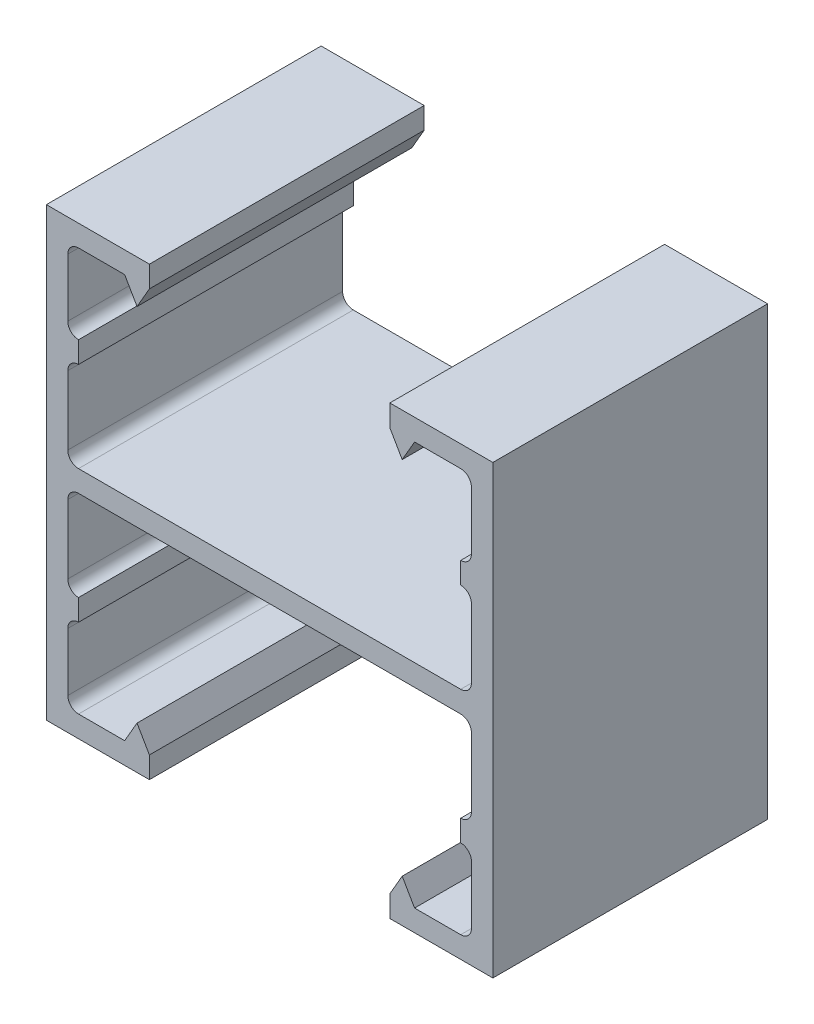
ISO-10303-21;
HEADER;
FILE_DESCRIPTION(('STEP AP214'),'2;1');
FILE_NAME('part.step','',(''),(''),'','','');
FILE_SCHEMA(('AUTOMOTIVE_DESIGN { 1 0 10303 214 1 1 1 1 }'));
ENDSEC;
DATA;
#1=APPLICATION_CONTEXT('core data for automotive mechanical design processes');
#2=APPLICATION_PROTOCOL_DEFINITION('international standard','automotive_design',2000,#1);
#3=PRODUCT_CONTEXT('',#1,'mechanical');
#4=PRODUCT('Part','Part','',(#3));
#5=PRODUCT_RELATED_PRODUCT_CATEGORY('part','',(#4));
#6=PRODUCT_DEFINITION_FORMATION('','',#4);
#7=PRODUCT_DEFINITION_CONTEXT('part definition',#1,'design');
#8=PRODUCT_DEFINITION('design','',#6,#7);
#9=PRODUCT_DEFINITION_SHAPE('','',#8);
#10=(LENGTH_UNIT() NAMED_UNIT(*) SI_UNIT(.MILLI.,.METRE.));
#11=(NAMED_UNIT(*) PLANE_ANGLE_UNIT() SI_UNIT($,.RADIAN.));
#12=(NAMED_UNIT(*) SI_UNIT($,.STERADIAN.) SOLID_ANGLE_UNIT());
#13=UNCERTAINTY_MEASURE_WITH_UNIT(LENGTH_MEASURE(1.E-05),#10,'distance_accuracy_value','');
#14=(GEOMETRIC_REPRESENTATION_CONTEXT(3) GLOBAL_UNCERTAINTY_ASSIGNED_CONTEXT((#13)) GLOBAL_UNIT_ASSIGNED_CONTEXT((#10,
#11,#12)) REPRESENTATION_CONTEXT('',''));
#15=CARTESIAN_POINT('',(0.,0.,0.));
#16=DIRECTION('',(0.,0.,1.));
#17=DIRECTION('',(1.,0.,0.));
#18=AXIS2_PLACEMENT_3D('',#15,#16,#17);
#19=CARTESIAN_POINT('',(-17.6657,1.9812,12.7));
#20=DIRECTION('',(0.,0.,-1.));
#21=DIRECTION('',(-1.,0.,0.));
#22=AXIS2_PLACEMENT_3D('',#19,#20,#21);
#23=CYLINDRICAL_SURFACE('',#22,0.990600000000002);
#24=CARTESIAN_POINT('',(-17.6657,1.9812,-12.7));
#25=DIRECTION('',(0.,0.,-1.));
#26=DIRECTION('',(1.,0.,0.));
#27=AXIS2_PLACEMENT_3D('',#24,#25,#26);
#28=CIRCLE('',#27,0.990600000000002);
#29=CARTESIAN_POINT('',(-17.6657,0.990599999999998,-12.7));
#30=VERTEX_POINT('',#29);
#31=CARTESIAN_POINT('',(-18.6563,1.9812,-12.7));
#32=VERTEX_POINT('',#31);
#33=EDGE_CURVE('E383',#30,#32,#28,.T.);
#34=ORIENTED_EDGE('',*,*,#33,.T.);
#35=DIRECTION('',(0.,0.,-1.));
#36=VECTOR('',#35,1.);
#37=CARTESIAN_POINT('',(-18.6563,1.9812,12.7));
#38=LINE('',#37,#36);
#39=CARTESIAN_POINT('',(-18.6563,1.9812,12.7));
#40=VERTEX_POINT('',#39);
#41=EDGE_CURVE('E365',#40,#32,#38,.T.);
#42=ORIENTED_EDGE('',*,*,#41,.F.);
#43=CARTESIAN_POINT('',(-17.6657,1.9812,12.7));
#44=DIRECTION('',(0.,0.,-1.));
#45=DIRECTION('',(1.,0.,0.));
#46=AXIS2_PLACEMENT_3D('',#43,#44,#45);
#47=CIRCLE('',#46,0.990600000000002);
#48=CARTESIAN_POINT('',(-17.6657,0.990599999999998,12.7));
#49=VERTEX_POINT('',#48);
#50=EDGE_CURVE('E371',#49,#40,#47,.T.);
#51=ORIENTED_EDGE('',*,*,#50,.F.);
#52=DIRECTION('',(0.,0.,-1.));
#53=VECTOR('',#52,1.);
#54=CARTESIAN_POINT('',(-17.6657,0.990599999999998,12.7));
#55=LINE('',#54,#53);
#56=EDGE_CURVE('E621',#49,#30,#55,.T.);
#57=ORIENTED_EDGE('',*,*,#56,.T.);
#58=EDGE_LOOP('',(#34,#42,#51,#57));
#59=FACE_BOUND('',#58,.T.);
#60=ADVANCED_FACE('F33',(#59),#23,.F.);
#61=CARTESIAN_POINT('',(-18.6563,9.32814999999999,12.7));
#62=DIRECTION('',(-1.,0.,0.));
#63=DIRECTION('',(0.,0.,1.));
#64=AXIS2_PLACEMENT_3D('',#61,#62,#63);
#65=PLANE('',#64);
#66=DIRECTION('',(0.,1.,0.));
#67=VECTOR('',#66,1.);
#68=CARTESIAN_POINT('',(-18.6563,9.32814999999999,-12.7));
#69=LINE('',#68,#67);
#70=CARTESIAN_POINT('',(-18.6563,8.33754999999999,-12.7));
#71=VERTEX_POINT('',#70);
#72=EDGE_CURVE('E535',#32,#71,#69,.T.);
#73=ORIENTED_EDGE('',*,*,#72,.T.);
#74=DIRECTION('',(0.,0.,-1.));
#75=VECTOR('',#74,1.);
#76=CARTESIAN_POINT('',(-18.6563,8.33754999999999,12.7));
#77=LINE('',#76,#75);
#78=CARTESIAN_POINT('',(-18.6563,8.33754999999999,12.7));
#79=VERTEX_POINT('',#78);
#80=EDGE_CURVE('E368',#71,#79,#77,.F.);
#81=ORIENTED_EDGE('',*,*,#80,.T.);
#82=DIRECTION('',(0.,1.,0.));
#83=VECTOR('',#82,1.);
#84=CARTESIAN_POINT('',(-18.6563,9.32814999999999,12.7));
#85=LINE('',#84,#83);
#86=EDGE_CURVE('E360',#40,#79,#85,.T.);
#87=ORIENTED_EDGE('',*,*,#86,.F.);
#88=ORIENTED_EDGE('',*,*,#41,.T.);
#89=EDGE_LOOP('',(#73,#81,#87,#88));
#90=FACE_BOUND('',#89,.T.);
#91=ADVANCED_FACE('F363',(#90),#65,.F.);
#92=CARTESIAN_POINT('',(-17.6657,11.30935,12.7));
#93=DIRECTION('',(-1.,0.,0.));
#94=DIRECTION('',(0.,0.,1.));
#95=AXIS2_PLACEMENT_3D('',#92,#93,#94);
#96=PLANE('',#95);
#97=DIRECTION('',(0.,1.,0.));
#98=VECTOR('',#97,1.);
#99=CARTESIAN_POINT('',(-17.6657,11.30935,-12.7));
#100=LINE('',#99,#98);
#101=CARTESIAN_POINT('',(-17.6657,9.32814999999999,-12.7));
#102=VERTEX_POINT('',#101);
#103=CARTESIAN_POINT('',(-17.6657,11.30935,-12.7));
#104=VERTEX_POINT('',#103);
#105=EDGE_CURVE('E533',#102,#104,#100,.T.);
#106=ORIENTED_EDGE('',*,*,#105,.T.);
#107=DIRECTION('',(0.,0.,-1.));
#108=VECTOR('',#107,1.);
#109=CARTESIAN_POINT('',(-17.6657,11.30935,12.7));
#110=LINE('',#109,#108);
#111=CARTESIAN_POINT('',(-17.6657,11.30935,12.7));
#112=VERTEX_POINT('',#111);
#113=EDGE_CURVE('E390',#112,#104,#110,.T.);
#114=ORIENTED_EDGE('',*,*,#113,.F.);
#115=DIRECTION('',(0.,1.,0.));
#116=VECTOR('',#115,1.);
#117=CARTESIAN_POINT('',(-17.6657,11.30935,12.7));
#118=LINE('',#117,#116);
#119=CARTESIAN_POINT('',(-17.6657,9.32814999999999,12.7));
#120=VERTEX_POINT('',#119);
#121=EDGE_CURVE('E370',#120,#112,#118,.T.);
#122=ORIENTED_EDGE('',*,*,#121,.F.);
#123=DIRECTION('',(0.,0.,-1.));
#124=VECTOR('',#123,1.);
#125=CARTESIAN_POINT('',(-17.6657,9.32814999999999,12.7));
#126=LINE('',#125,#124);
#127=EDGE_CURVE('E385',#120,#102,#126,.T.);
#128=ORIENTED_EDGE('',*,*,#127,.T.);
#129=EDGE_LOOP('',(#106,#114,#122,#128));
#130=FACE_BOUND('',#129,.T.);
#131=ADVANCED_FACE('F530',(#130),#96,.F.);
#132=CARTESIAN_POINT('',(-18.6563,17.6657,12.7));
#133=DIRECTION('',(-1.,0.,0.));
#134=DIRECTION('',(0.,-1.,0.));
#135=AXIS2_PLACEMENT_3D('',#132,#133,#134);
#136=PLANE('',#135);
#137=DIRECTION('',(0.,1.,0.));
#138=VECTOR('',#137,1.);
#139=CARTESIAN_POINT('',(-18.6563,17.6657,12.7));
#140=LINE('',#139,#138);
#141=CARTESIAN_POINT('',(-18.6563,12.29995,12.7));
#142=VERTEX_POINT('',#141);
#143=CARTESIAN_POINT('',(-18.6563,17.6657,12.7));
#144=VERTEX_POINT('',#143);
#145=EDGE_CURVE('E738',#142,#144,#140,.T.);
#146=ORIENTED_EDGE('',*,*,#145,.F.);
#147=DIRECTION('',(0.,0.,-1.));
#148=VECTOR('',#147,1.);
#149=CARTESIAN_POINT('',(-18.6563,12.29995,-12.7));
#150=LINE('',#149,#148);
#151=CARTESIAN_POINT('',(-18.6563,12.29995,-12.7));
#152=VERTEX_POINT('',#151);
#153=EDGE_CURVE('E395',#142,#152,#150,.T.);
#154=ORIENTED_EDGE('',*,*,#153,.T.);
#155=DIRECTION('',(0.,1.,0.));
#156=VECTOR('',#155,1.);
#157=CARTESIAN_POINT('',(-18.6563,17.6657,-12.7));
#158=LINE('',#157,#156);
#159=CARTESIAN_POINT('',(-18.6563,17.6657,-12.7));
#160=VERTEX_POINT('',#159);
#161=EDGE_CURVE('E534',#152,#160,#158,.T.);
#162=ORIENTED_EDGE('',*,*,#161,.T.);
#163=DIRECTION('',(0.,0.,-1.));
#164=VECTOR('',#163,1.);
#165=CARTESIAN_POINT('',(-18.6563,17.6657,12.7));
#166=LINE('',#165,#164);
#167=EDGE_CURVE('E519',#144,#160,#166,.T.);
#168=ORIENTED_EDGE('',*,*,#167,.F.);
#169=EDGE_LOOP('',(#146,#154,#162,#168));
#170=FACE_BOUND('',#169,.T.);
#171=ADVANCED_FACE('F1023',(#170),#136,.F.);
#172=CARTESIAN_POINT('',(-17.6657,17.6657,12.7));
#173=DIRECTION('',(0.,0.,-1.));
#174=DIRECTION('',(-1.,0.,0.));
#175=AXIS2_PLACEMENT_3D('',#172,#173,#174);
#176=CYLINDRICAL_SURFACE('',#175,0.990600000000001);
#177=CARTESIAN_POINT('',(-17.6657,17.6657,-12.7));
#178=DIRECTION('',(0.,0.,-1.));
#179=DIRECTION('',(1.,0.,0.));
#180=AXIS2_PLACEMENT_3D('',#177,#178,#179);
#181=CIRCLE('',#180,0.990600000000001);
#182=CARTESIAN_POINT('',(-17.6657,18.6563,-12.7));
#183=VERTEX_POINT('',#182);
#184=EDGE_CURVE('E537',#160,#183,#181,.T.);
#185=ORIENTED_EDGE('',*,*,#184,.T.);
#186=DIRECTION('',(0.,0.,-1.));
#187=VECTOR('',#186,1.);
#188=CARTESIAN_POINT('',(-17.6657,18.6563,12.7));
#189=LINE('',#188,#187);
#190=CARTESIAN_POINT('',(-17.6657,18.6563,12.7));
#191=VERTEX_POINT('',#190);
#192=EDGE_CURVE('E516',#191,#183,#189,.T.);
#193=ORIENTED_EDGE('',*,*,#192,.F.);
#194=CARTESIAN_POINT('',(-17.6657,17.6657,12.7));
#195=DIRECTION('',(0.,0.,-1.));
#196=DIRECTION('',(1.,0.,0.));
#197=AXIS2_PLACEMENT_3D('',#194,#195,#196);
#198=CIRCLE('',#197,0.990600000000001);
#199=EDGE_CURVE('E740',#144,#191,#198,.T.);
#200=ORIENTED_EDGE('',*,*,#199,.F.);
#201=ORIENTED_EDGE('',*,*,#167,.T.);
#202=EDGE_LOOP('',(#185,#193,#200,#201));
#203=FACE_BOUND('',#202,.T.);
#204=ADVANCED_FACE('F1031',(#203),#176,.F.);
#205=CARTESIAN_POINT('',(-13.400192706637,18.6563,12.7));
#206=DIRECTION('',(0.,1.,0.));
#207=DIRECTION('',(-1.,0.,0.));
#208=AXIS2_PLACEMENT_3D('',#205,#206,#207);
#209=PLANE('',#208);
#210=DIRECTION('',(1.,0.,0.));
#211=VECTOR('',#210,1.);
#212=CARTESIAN_POINT('',(-13.400192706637,18.6563,-12.7));
#213=LINE('',#212,#211);
#214=CARTESIAN_POINT('',(-13.400192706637,18.6563,-12.7));
#215=VERTEX_POINT('',#214);
#216=EDGE_CURVE('E543',#183,#215,#213,.T.);
#217=ORIENTED_EDGE('',*,*,#216,.T.);
#218=DIRECTION('',(0.,0.,-1.));
#219=VECTOR('',#218,1.);
#220=CARTESIAN_POINT('',(-13.400192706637,18.6563,12.7));
#221=LINE('',#220,#219);
#222=CARTESIAN_POINT('',(-13.400192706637,18.6563,12.7));
#223=VERTEX_POINT('',#222);
#224=EDGE_CURVE('E513',#223,#215,#221,.T.);
#225=ORIENTED_EDGE('',*,*,#224,.F.);
#226=DIRECTION('',(1.,0.,0.));
#227=VECTOR('',#226,1.);
#228=CARTESIAN_POINT('',(-13.400192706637,18.6563,12.7));
#229=LINE('',#228,#227);
#230=EDGE_CURVE('E744',#191,#223,#229,.T.);
#231=ORIENTED_EDGE('',*,*,#230,.F.);
#232=ORIENTED_EDGE('',*,*,#192,.T.);
#233=EDGE_LOOP('',(#217,#225,#231,#232));
#234=FACE_BOUND('',#233,.T.);
#235=ADVANCED_FACE('F1311',(#234),#209,.F.);
#236=CARTESIAN_POINT('',(-13.400192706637,18.6563,12.7));
#237=DIRECTION('',(0.86602540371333,0.500000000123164,0.));
#238=DIRECTION('',(-0.500000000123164,0.86602540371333,0.));
#239=AXIS2_PLACEMENT_3D('',#236,#237,#238);
#240=PLANE('',#239);
#241=DIRECTION('',(0.500000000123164,-0.86602540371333,0.));
#242=VECTOR('',#241,1.);
#243=CARTESIAN_POINT('',(-13.400192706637,18.6563,-12.7));
#244=LINE('',#243,#242);
#245=CARTESIAN_POINT('',(-12.2563463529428,16.6751,-12.7));
#246=VERTEX_POINT('',#245);
#247=EDGE_CURVE('E545',#215,#246,#244,.T.);
#248=ORIENTED_EDGE('',*,*,#247,.T.);
#249=DIRECTION('',(0.,0.,-1.));
#250=VECTOR('',#249,1.);
#251=CARTESIAN_POINT('',(-12.2563463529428,16.6751,12.7));
#252=LINE('',#251,#250);
#253=CARTESIAN_POINT('',(-12.2563463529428,16.6751,12.7));
#254=VERTEX_POINT('',#253);
#255=EDGE_CURVE('E510',#254,#246,#252,.T.);
#256=ORIENTED_EDGE('',*,*,#255,.F.);
#257=DIRECTION('',(0.500000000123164,-0.86602540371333,0.));
#258=VECTOR('',#257,1.);
#259=CARTESIAN_POINT('',(-13.400192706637,18.6563,12.7));
#260=LINE('',#259,#258);
#261=EDGE_CURVE('E746',#223,#254,#260,.T.);
#262=ORIENTED_EDGE('',*,*,#261,.F.);
#263=ORIENTED_EDGE('',*,*,#224,.T.);
#264=EDGE_LOOP('',(#248,#256,#262,#263));
#265=FACE_BOUND('',#264,.T.);
#266=ADVANCED_FACE('F1301',(#265),#240,.F.);
#267=CARTESIAN_POINT('',(-12.2563463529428,16.6751,12.7));
#268=DIRECTION('',(-0.866025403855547,0.499999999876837,0.));
#269=DIRECTION('',(-0.499999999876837,-0.866025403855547,0.));
#270=AXIS2_PLACEMENT_3D('',#267,#268,#269);
#271=PLANE('',#270);
#272=DIRECTION('',(0.499999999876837,0.866025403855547,0.));
#273=VECTOR('',#272,1.);
#274=CARTESIAN_POINT('',(-12.2563463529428,16.6751,-12.7));
#275=LINE('',#274,#273);
#276=CARTESIAN_POINT('',(-11.1125,18.6563,-12.7));
#277=VERTEX_POINT('',#276);
#278=EDGE_CURVE('E547',#246,#277,#275,.T.);
#279=ORIENTED_EDGE('',*,*,#278,.T.);
#280=DIRECTION('',(0.,0.,-1.));
#281=VECTOR('',#280,1.);
#282=CARTESIAN_POINT('',(-11.1125,18.6563,12.7));
#283=LINE('',#282,#281);
#284=CARTESIAN_POINT('',(-11.1125,18.6563,12.7));
#285=VERTEX_POINT('',#284);
#286=EDGE_CURVE('E507',#285,#277,#283,.T.);
#287=ORIENTED_EDGE('',*,*,#286,.F.);
#288=DIRECTION('',(0.499999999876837,0.866025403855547,0.));
#289=VECTOR('',#288,1.);
#290=CARTESIAN_POINT('',(-12.2563463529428,16.6751,12.7));
#291=LINE('',#290,#289);
#292=EDGE_CURVE('E748',#254,#285,#291,.T.);
#293=ORIENTED_EDGE('',*,*,#292,.F.);
#294=ORIENTED_EDGE('',*,*,#255,.T.);
#295=EDGE_LOOP('',(#279,#287,#293,#294));
#296=FACE_BOUND('',#295,.T.);
#297=ADVANCED_FACE('F1291',(#296),#271,.F.);
#298=CARTESIAN_POINT('',(-11.1125,18.6563,12.7));
#299=DIRECTION('',(-1.,0.,0.));
#300=DIRECTION('',(0.,-1.,0.));
#301=AXIS2_PLACEMENT_3D('',#298,#299,#300);
#302=PLANE('',#301);
#303=DIRECTION('',(0.,1.,0.));
#304=VECTOR('',#303,1.);
#305=CARTESIAN_POINT('',(-11.1125,18.6563,-12.7));
#306=LINE('',#305,#304);
#307=CARTESIAN_POINT('',(-11.1125,20.6375,-12.7));
#308=VERTEX_POINT('',#307);
#309=EDGE_CURVE('E549',#277,#308,#306,.T.);
#310=ORIENTED_EDGE('',*,*,#309,.T.);
#311=DIRECTION('',(0.,0.,-1.));
#312=VECTOR('',#311,1.);
#313=CARTESIAN_POINT('',(-11.1125,20.6375,12.7));
#314=LINE('',#313,#312);
#315=CARTESIAN_POINT('',(-11.1125,20.6375,12.7));
#316=VERTEX_POINT('',#315);
#317=EDGE_CURVE('E504',#316,#308,#314,.T.);
#318=ORIENTED_EDGE('',*,*,#317,.F.);
#319=DIRECTION('',(0.,1.,0.));
#320=VECTOR('',#319,1.);
#321=CARTESIAN_POINT('',(-11.1125,18.6563,12.7));
#322=LINE('',#321,#320);
#323=EDGE_CURVE('E750',#285,#316,#322,.T.);
#324=ORIENTED_EDGE('',*,*,#323,.F.);
#325=ORIENTED_EDGE('',*,*,#286,.T.);
#326=EDGE_LOOP('',(#310,#318,#324,#325));
#327=FACE_BOUND('',#326,.T.);
#328=ADVANCED_FACE('F1281',(#327),#302,.F.);
#329=CARTESIAN_POINT('',(-11.1125,20.6375,12.7));
#330=DIRECTION('',(0.,-1.,0.));
#331=DIRECTION('',(0.,0.,-1.));
#332=AXIS2_PLACEMENT_3D('',#329,#330,#331);
#333=PLANE('',#332);
#334=DIRECTION('',(-1.,0.,0.));
#335=VECTOR('',#334,1.);
#336=CARTESIAN_POINT('',(-11.1125,20.6375,-12.7));
#337=LINE('',#336,#335);
#338=CARTESIAN_POINT('',(-20.6375,20.6375,-12.7));
#339=VERTEX_POINT('',#338);
#340=EDGE_CURVE('E551',#308,#339,#337,.T.);
#341=ORIENTED_EDGE('',*,*,#340,.T.);
#342=DIRECTION('',(0.,0.,-1.));
#343=VECTOR('',#342,1.);
#344=CARTESIAN_POINT('',(-20.6375,20.6375,12.7));
#345=LINE('',#344,#343);
#346=CARTESIAN_POINT('',(-20.6375,20.6375,12.7));
#347=VERTEX_POINT('',#346);
#348=EDGE_CURVE('E501',#347,#339,#345,.T.);
#349=ORIENTED_EDGE('',*,*,#348,.F.);
#350=DIRECTION('',(-1.,0.,0.));
#351=VECTOR('',#350,1.);
#352=CARTESIAN_POINT('',(-11.1125,20.6375,12.7));
#353=LINE('',#352,#351);
#354=EDGE_CURVE('E752',#316,#347,#353,.T.);
#355=ORIENTED_EDGE('',*,*,#354,.F.);
#356=ORIENTED_EDGE('',*,*,#317,.T.);
#357=EDGE_LOOP('',(#341,#349,#355,#356));
#358=FACE_BOUND('',#357,.T.);
#359=ADVANCED_FACE('F1271',(#358),#333,.F.);
#360=CARTESIAN_POINT('',(-20.6375,20.6375,12.7));
#361=DIRECTION('',(1.,0.,0.));
#362=DIRECTION('',(0.,1.,0.));
#363=AXIS2_PLACEMENT_3D('',#360,#361,#362);
#364=PLANE('',#363);
#365=DIRECTION('',(0.,-1.,0.));
#366=VECTOR('',#365,1.);
#367=CARTESIAN_POINT('',(-20.6375,20.6375,-12.7));
#368=LINE('',#367,#366);
#369=CARTESIAN_POINT('',(-20.6375,-20.6375,-12.7));
#370=VERTEX_POINT('',#369);
#371=EDGE_CURVE('E553',#339,#370,#368,.T.);
#372=ORIENTED_EDGE('',*,*,#371,.T.);
#373=DIRECTION('',(0.,0.,-1.));
#374=VECTOR('',#373,1.);
#375=CARTESIAN_POINT('',(-20.6375,-20.6375,12.7));
#376=LINE('',#375,#374);
#377=CARTESIAN_POINT('',(-20.6375,-20.6375,12.7));
#378=VERTEX_POINT('',#377);
#379=EDGE_CURVE('E498',#378,#370,#376,.T.);
#380=ORIENTED_EDGE('',*,*,#379,.F.);
#381=DIRECTION('',(0.,-1.,0.));
#382=VECTOR('',#381,1.);
#383=CARTESIAN_POINT('',(-20.6375,20.6375,12.7));
#384=LINE('',#383,#382);
#385=EDGE_CURVE('E754',#347,#378,#384,.T.);
#386=ORIENTED_EDGE('',*,*,#385,.F.);
#387=ORIENTED_EDGE('',*,*,#348,.T.);
#388=EDGE_LOOP('',(#372,#380,#386,#387));
#389=FACE_BOUND('',#388,.T.);
#390=ADVANCED_FACE('F1261',(#389),#364,.F.);
#391=CARTESIAN_POINT('',(-11.1125,-20.6375,12.7));
#392=DIRECTION('',(0.,1.,0.));
#393=DIRECTION('',(-1.,0.,0.));
#394=AXIS2_PLACEMENT_3D('',#391,#392,#393);
#395=PLANE('',#394);
#396=DIRECTION('',(1.,0.,0.));
#397=VECTOR('',#396,1.);
#398=CARTESIAN_POINT('',(-11.1125,-20.6375,-12.7));
#399=LINE('',#398,#397);
#400=CARTESIAN_POINT('',(-11.1125,-20.6375,-12.7));
#401=VERTEX_POINT('',#400);
#402=EDGE_CURVE('E555',#370,#401,#399,.T.);
#403=ORIENTED_EDGE('',*,*,#402,.T.);
#404=DIRECTION('',(0.,0.,-1.));
#405=VECTOR('',#404,1.);
#406=CARTESIAN_POINT('',(-11.1125,-20.6375,12.7));
#407=LINE('',#406,#405);
#408=CARTESIAN_POINT('',(-11.1125,-20.6375,12.7));
#409=VERTEX_POINT('',#408);
#410=EDGE_CURVE('E495',#409,#401,#407,.T.);
#411=ORIENTED_EDGE('',*,*,#410,.F.);
#412=DIRECTION('',(1.,0.,0.));
#413=VECTOR('',#412,1.);
#414=CARTESIAN_POINT('',(-11.1125,-20.6375,12.7));
#415=LINE('',#414,#413);
#416=EDGE_CURVE('E756',#378,#409,#415,.T.);
#417=ORIENTED_EDGE('',*,*,#416,.F.);
#418=ORIENTED_EDGE('',*,*,#379,.T.);
#419=EDGE_LOOP('',(#403,#411,#417,#418));
#420=FACE_BOUND('',#419,.T.);
#421=ADVANCED_FACE('F1251',(#420),#395,.F.);
#422=CARTESIAN_POINT('',(-11.1125,-18.6563,12.7));
#423=DIRECTION('',(-1.,0.,0.));
#424=DIRECTION('',(0.,-1.,0.));
#425=AXIS2_PLACEMENT_3D('',#422,#423,#424);
#426=PLANE('',#425);
#427=DIRECTION('',(0.,1.,0.));
#428=VECTOR('',#427,1.);
#429=CARTESIAN_POINT('',(-11.1125,-18.6563,-12.7));
#430=LINE('',#429,#428);
#431=CARTESIAN_POINT('',(-11.1125,-18.6563,-12.7));
#432=VERTEX_POINT('',#431);
#433=EDGE_CURVE('E557',#401,#432,#430,.T.);
#434=ORIENTED_EDGE('',*,*,#433,.T.);
#435=DIRECTION('',(0.,0.,-1.));
#436=VECTOR('',#435,1.);
#437=CARTESIAN_POINT('',(-11.1125,-18.6563,12.7));
#438=LINE('',#437,#436);
#439=CARTESIAN_POINT('',(-11.1125,-18.6563,12.7));
#440=VERTEX_POINT('',#439);
#441=EDGE_CURVE('E492',#440,#432,#438,.T.);
#442=ORIENTED_EDGE('',*,*,#441,.F.);
#443=DIRECTION('',(0.,1.,0.));
#444=VECTOR('',#443,1.);
#445=CARTESIAN_POINT('',(-11.1125,-18.6563,12.7));
#446=LINE('',#445,#444);
#447=EDGE_CURVE('E758',#409,#440,#446,.T.);
#448=ORIENTED_EDGE('',*,*,#447,.F.);
#449=ORIENTED_EDGE('',*,*,#410,.T.);
#450=EDGE_LOOP('',(#434,#442,#448,#449));
#451=FACE_BOUND('',#450,.T.);
#452=ADVANCED_FACE('F1241',(#451),#426,.F.);
#453=CARTESIAN_POINT('',(-12.2563463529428,-16.6751,12.7));
#454=DIRECTION('',(-0.866025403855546,-0.499999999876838,0.));
#455=DIRECTION('',(0.499999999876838,-0.866025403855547,0.));
#456=AXIS2_PLACEMENT_3D('',#453,#454,#455);
#457=PLANE('',#456);
#458=DIRECTION('',(-0.499999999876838,0.866025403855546,0.));
#459=VECTOR('',#458,1.);
#460=CARTESIAN_POINT('',(-12.2563463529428,-16.6751,-12.7));
#461=LINE('',#460,#459);
#462=CARTESIAN_POINT('',(-12.2563463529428,-16.6751,-12.7));
#463=VERTEX_POINT('',#462);
#464=EDGE_CURVE('E559',#432,#463,#461,.T.);
#465=ORIENTED_EDGE('',*,*,#464,.T.);
#466=DIRECTION('',(0.,0.,-1.));
#467=VECTOR('',#466,1.);
#468=CARTESIAN_POINT('',(-12.2563463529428,-16.6751,12.7));
#469=LINE('',#468,#467);
#470=CARTESIAN_POINT('',(-12.2563463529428,-16.6751,12.7));
#471=VERTEX_POINT('',#470);
#472=EDGE_CURVE('E489',#471,#463,#469,.T.);
#473=ORIENTED_EDGE('',*,*,#472,.F.);
#474=DIRECTION('',(-0.499999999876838,0.866025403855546,0.));
#475=VECTOR('',#474,1.);
#476=CARTESIAN_POINT('',(-12.2563463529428,-16.6751,12.7));
#477=LINE('',#476,#475);
#478=EDGE_CURVE('E760',#440,#471,#477,.T.);
#479=ORIENTED_EDGE('',*,*,#478,.F.);
#480=ORIENTED_EDGE('',*,*,#441,.T.);
#481=EDGE_LOOP('',(#465,#473,#479,#480));
#482=FACE_BOUND('',#481,.T.);
#483=ADVANCED_FACE('F1231',(#482),#457,.F.);
#484=CARTESIAN_POINT('',(-13.400192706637,-18.6563,12.7));
#485=DIRECTION('',(0.86602540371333,-0.500000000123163,0.));
#486=DIRECTION('',(0.500000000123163,0.86602540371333,0.));
#487=AXIS2_PLACEMENT_3D('',#484,#485,#486);
#488=PLANE('',#487);
#489=DIRECTION('',(-0.500000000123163,-0.86602540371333,0.));
#490=VECTOR('',#489,1.);
#491=CARTESIAN_POINT('',(-13.400192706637,-18.6563,-12.7));
#492=LINE('',#491,#490);
#493=CARTESIAN_POINT('',(-13.400192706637,-18.6563,-12.7));
#494=VERTEX_POINT('',#493);
#495=EDGE_CURVE('E561',#463,#494,#492,.T.);
#496=ORIENTED_EDGE('',*,*,#495,.T.);
#497=DIRECTION('',(0.,0.,-1.));
#498=VECTOR('',#497,1.);
#499=CARTESIAN_POINT('',(-13.400192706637,-18.6563,12.7));
#500=LINE('',#499,#498);
#501=CARTESIAN_POINT('',(-13.400192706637,-18.6563,12.7));
#502=VERTEX_POINT('',#501);
#503=EDGE_CURVE('E486',#502,#494,#500,.T.);
#504=ORIENTED_EDGE('',*,*,#503,.F.);
#505=DIRECTION('',(-0.500000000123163,-0.86602540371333,0.));
#506=VECTOR('',#505,1.);
#507=CARTESIAN_POINT('',(-13.400192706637,-18.6563,12.7));
#508=LINE('',#507,#506);
#509=EDGE_CURVE('E762',#471,#502,#508,.T.);
#510=ORIENTED_EDGE('',*,*,#509,.F.);
#511=ORIENTED_EDGE('',*,*,#472,.T.);
#512=EDGE_LOOP('',(#496,#504,#510,#511));
#513=FACE_BOUND('',#512,.T.);
#514=ADVANCED_FACE('F1221',(#513),#488,.F.);
#515=CARTESIAN_POINT('',(-13.400192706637,-18.6563,12.7));
#516=DIRECTION('',(0.,-1.,0.));
#517=DIRECTION('',(1.,0.,0.));
#518=AXIS2_PLACEMENT_3D('',#515,#516,#517);
#519=PLANE('',#518);
#520=DIRECTION('',(-1.,0.,0.));
#521=VECTOR('',#520,1.);
#522=CARTESIAN_POINT('',(-13.400192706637,-18.6563,-12.7));
#523=LINE('',#522,#521);
#524=CARTESIAN_POINT('',(-17.6657,-18.6563,-12.7));
#525=VERTEX_POINT('',#524);
#526=EDGE_CURVE('E563',#494,#525,#523,.T.);
#527=ORIENTED_EDGE('',*,*,#526,.T.);
#528=DIRECTION('',(0.,0.,-1.));
#529=VECTOR('',#528,1.);
#530=CARTESIAN_POINT('',(-17.6657,-18.6563,12.7));
#531=LINE('',#530,#529);
#532=CARTESIAN_POINT('',(-17.6657,-18.6563,12.7));
#533=VERTEX_POINT('',#532);
#534=EDGE_CURVE('E483',#533,#525,#531,.T.);
#535=ORIENTED_EDGE('',*,*,#534,.F.);
#536=DIRECTION('',(-1.,0.,0.));
#537=VECTOR('',#536,1.);
#538=CARTESIAN_POINT('',(-13.400192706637,-18.6563,12.7));
#539=LINE('',#538,#537);
#540=EDGE_CURVE('E764',#502,#533,#539,.T.);
#541=ORIENTED_EDGE('',*,*,#540,.F.);
#542=ORIENTED_EDGE('',*,*,#503,.T.);
#543=EDGE_LOOP('',(#527,#535,#541,#542));
#544=FACE_BOUND('',#543,.T.);
#545=ADVANCED_FACE('F1211',(#544),#519,.F.);
#546=CARTESIAN_POINT('',(-17.6657,-17.6657,12.7));
#547=DIRECTION('',(0.,0.,-1.));
#548=DIRECTION('',(-1.,0.,0.));
#549=AXIS2_PLACEMENT_3D('',#546,#547,#548);
#550=CYLINDRICAL_SURFACE('',#549,0.990600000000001);
#551=CARTESIAN_POINT('',(-17.6657,-17.6657,-12.7));
#552=DIRECTION('',(0.,0.,-1.));
#553=DIRECTION('',(-1.,0.,0.));
#554=AXIS2_PLACEMENT_3D('',#551,#552,#553);
#555=CIRCLE('',#554,0.990600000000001);
#556=CARTESIAN_POINT('',(-18.6563,-17.6657,-12.7));
#557=VERTEX_POINT('',#556);
#558=EDGE_CURVE('E565',#525,#557,#555,.T.);
#559=ORIENTED_EDGE('',*,*,#558,.T.);
#560=DIRECTION('',(0.,0.,-1.));
#561=VECTOR('',#560,1.);
#562=CARTESIAN_POINT('',(-18.6563,-17.6657,12.7));
#563=LINE('',#562,#561);
#564=CARTESIAN_POINT('',(-18.6563,-17.6657,12.7));
#565=VERTEX_POINT('',#564);
#566=EDGE_CURVE('E480',#565,#557,#563,.T.);
#567=ORIENTED_EDGE('',*,*,#566,.F.);
#568=CARTESIAN_POINT('',(-17.6657,-17.6657,12.7));
#569=DIRECTION('',(0.,0.,-1.));
#570=DIRECTION('',(-1.,0.,0.));
#571=AXIS2_PLACEMENT_3D('',#568,#569,#570);
#572=CIRCLE('',#571,0.990600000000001);
#573=EDGE_CURVE('E766',#533,#565,#572,.T.);
#574=ORIENTED_EDGE('',*,*,#573,.F.);
#575=ORIENTED_EDGE('',*,*,#534,.T.);
#576=EDGE_LOOP('',(#559,#567,#574,#575));
#577=FACE_BOUND('',#576,.T.);
#578=ADVANCED_FACE('F1045',(#577),#550,.F.);
#579=CARTESIAN_POINT('',(-18.6563,-17.6657,12.7));
#580=DIRECTION('',(-1.,0.,0.));
#581=DIRECTION('',(0.,-1.,0.));
#582=AXIS2_PLACEMENT_3D('',#579,#580,#581);
#583=PLANE('',#582);
#584=DIRECTION('',(0.,1.,0.));
#585=VECTOR('',#584,1.);
#586=CARTESIAN_POINT('',(-18.6563,-17.6657,-12.7));
#587=LINE('',#586,#585);
#588=CARTESIAN_POINT('',(-18.6563,-12.29995,-12.7));
#589=VERTEX_POINT('',#588);
#590=EDGE_CURVE('E567',#557,#589,#587,.T.);
#591=ORIENTED_EDGE('',*,*,#590,.T.);
#592=DIRECTION('',(0.,0.,-1.));
#593=VECTOR('',#592,1.);
#594=CARTESIAN_POINT('',(-18.6563,-12.29995,12.7));
#595=LINE('',#594,#593);
#596=CARTESIAN_POINT('',(-18.6563,-12.29995,12.7));
#597=VERTEX_POINT('',#596);
#598=EDGE_CURVE('E402',#589,#597,#595,.F.);
#599=ORIENTED_EDGE('',*,*,#598,.T.);
#600=DIRECTION('',(0.,1.,0.));
#601=VECTOR('',#600,1.);
#602=CARTESIAN_POINT('',(-18.6563,-17.6657,12.7));
#603=LINE('',#602,#601);
#604=EDGE_CURVE('E768',#565,#597,#603,.T.);
#605=ORIENTED_EDGE('',*,*,#604,.F.);
#606=ORIENTED_EDGE('',*,*,#566,.T.);
#607=EDGE_LOOP('',(#591,#599,#605,#606));
#608=FACE_BOUND('',#607,.T.);
#609=ADVANCED_FACE('F1039',(#608),#583,.F.);
#610=CARTESIAN_POINT('',(-17.6657,-11.30935,12.7));
#611=DIRECTION('',(-1.,0.,0.));
#612=DIRECTION('',(0.,0.,1.));
#613=AXIS2_PLACEMENT_3D('',#610,#611,#612);
#614=PLANE('',#613);
#615=DIRECTION('',(0.,1.,0.));
#616=VECTOR('',#615,1.);
#617=CARTESIAN_POINT('',(-17.6657,-11.30935,-12.7));
#618=LINE('',#617,#616);
#619=CARTESIAN_POINT('',(-17.6657,-11.30935,-12.7));
#620=VERTEX_POINT('',#619);
#621=CARTESIAN_POINT('',(-17.6657,-9.32815,-12.7));
#622=VERTEX_POINT('',#621);
#623=EDGE_CURVE('E570',#620,#622,#618,.T.);
#624=ORIENTED_EDGE('',*,*,#623,.T.);
#625=DIRECTION('',(0.,0.,-1.));
#626=VECTOR('',#625,1.);
#627=CARTESIAN_POINT('',(-17.6657,-9.32815,12.7));
#628=LINE('',#627,#626);
#629=CARTESIAN_POINT('',(-17.6657,-9.32815,12.7));
#630=VERTEX_POINT('',#629);
#631=EDGE_CURVE('E474',#630,#622,#628,.T.);
#632=ORIENTED_EDGE('',*,*,#631,.F.);
#633=DIRECTION('',(0.,1.,0.));
#634=VECTOR('',#633,1.);
#635=CARTESIAN_POINT('',(-17.6657,-11.30935,12.7));
#636=LINE('',#635,#634);
#637=CARTESIAN_POINT('',(-17.6657,-11.30935,12.7));
#638=VERTEX_POINT('',#637);
#639=EDGE_CURVE('E771',#638,#630,#636,.T.);
#640=ORIENTED_EDGE('',*,*,#639,.F.);
#641=DIRECTION('',(0.,0.,-1.));
#642=VECTOR('',#641,1.);
#643=CARTESIAN_POINT('',(-17.6657,-11.30935,12.7));
#644=LINE('',#643,#642);
#645=EDGE_CURVE('E477',#638,#620,#644,.T.);
#646=ORIENTED_EDGE('',*,*,#645,.T.);
#647=EDGE_LOOP('',(#624,#632,#640,#646));
#648=FACE_BOUND('',#647,.T.);
#649=ADVANCED_FACE('F1044',(#648),#614,.F.);
#650=CARTESIAN_POINT('',(-18.6563,-9.32815,12.7));
#651=DIRECTION('',(-1.,0.,0.));
#652=DIRECTION('',(0.,-1.,0.));
#653=AXIS2_PLACEMENT_3D('',#650,#651,#652);
#654=PLANE('',#653);
#655=DIRECTION('',(0.,1.,0.));
#656=VECTOR('',#655,1.);
#657=CARTESIAN_POINT('',(-18.6563,-9.32815,12.7));
#658=LINE('',#657,#656);
#659=CARTESIAN_POINT('',(-18.6563,-8.33755,12.7));
#660=VERTEX_POINT('',#659);
#661=CARTESIAN_POINT('',(-18.6563,-1.9812,12.7));
#662=VERTEX_POINT('',#661);
#663=EDGE_CURVE('E773',#660,#662,#658,.T.);
#664=ORIENTED_EDGE('',*,*,#663,.F.);
#665=DIRECTION('',(0.,0.,-1.));
#666=VECTOR('',#665,1.);
#667=CARTESIAN_POINT('',(-18.6563,-8.33755,-12.7));
#668=LINE('',#667,#666);
#669=CARTESIAN_POINT('',(-18.6563,-8.33755,-12.7));
#670=VERTEX_POINT('',#669);
#671=EDGE_CURVE('E398',#660,#670,#668,.T.);
#672=ORIENTED_EDGE('',*,*,#671,.T.);
#673=DIRECTION('',(0.,1.,0.));
#674=VECTOR('',#673,1.);
#675=CARTESIAN_POINT('',(-18.6563,-9.32815,-12.7));
#676=LINE('',#675,#674);
#677=CARTESIAN_POINT('',(-18.6563,-1.9812,-12.7));
#678=VERTEX_POINT('',#677);
#679=EDGE_CURVE('E573',#670,#678,#676,.T.);
#680=ORIENTED_EDGE('',*,*,#679,.T.);
#681=DIRECTION('',(0.,0.,-1.));
#682=VECTOR('',#681,1.);
#683=CARTESIAN_POINT('',(-18.6563,-1.9812,12.7));
#684=LINE('',#683,#682);
#685=EDGE_CURVE('E471',#662,#678,#684,.T.);
#686=ORIENTED_EDGE('',*,*,#685,.F.);
#687=EDGE_LOOP('',(#664,#672,#680,#686));
#688=FACE_BOUND('',#687,.T.);
#689=ADVANCED_FACE('F1057',(#688),#654,.F.);
#690=CARTESIAN_POINT('',(-17.6657,-1.9812,12.7));
#691=DIRECTION('',(0.,0.,-1.));
#692=DIRECTION('',(-1.,0.,0.));
#693=AXIS2_PLACEMENT_3D('',#690,#691,#692);
#694=CYLINDRICAL_SURFACE('',#693,0.990600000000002);
#695=CARTESIAN_POINT('',(-17.6657,-1.9812,-12.7));
#696=DIRECTION('',(0.,0.,-1.));
#697=DIRECTION('',(-1.,0.,0.));
#698=AXIS2_PLACEMENT_3D('',#695,#696,#697);
#699=CIRCLE('',#698,0.990600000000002);
#700=CARTESIAN_POINT('',(-17.6657,-0.990599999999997,-12.7));
#701=VERTEX_POINT('',#700);
#702=EDGE_CURVE('E575',#678,#701,#699,.T.);
#703=ORIENTED_EDGE('',*,*,#702,.T.);
#704=DIRECTION('',(0.,0.,-1.));
#705=VECTOR('',#704,1.);
#706=CARTESIAN_POINT('',(-17.6657,-0.990599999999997,12.7));
#707=LINE('',#706,#705);
#708=CARTESIAN_POINT('',(-17.6657,-0.990599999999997,12.7));
#709=VERTEX_POINT('',#708);
#710=EDGE_CURVE('E468',#709,#701,#707,.T.);
#711=ORIENTED_EDGE('',*,*,#710,.F.);
#712=CARTESIAN_POINT('',(-17.6657,-1.9812,12.7));
#713=DIRECTION('',(0.,0.,-1.));
#714=DIRECTION('',(-1.,0.,0.));
#715=AXIS2_PLACEMENT_3D('',#712,#713,#714);
#716=CIRCLE('',#715,0.990600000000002);
#717=EDGE_CURVE('E775',#662,#709,#716,.T.);
#718=ORIENTED_EDGE('',*,*,#717,.F.);
#719=ORIENTED_EDGE('',*,*,#685,.T.);
#720=EDGE_LOOP('',(#703,#711,#718,#719));
#721=FACE_BOUND('',#720,.T.);
#722=ADVANCED_FACE('F1067',(#721),#694,.F.);
#723=CARTESIAN_POINT('',(-17.6657,-0.9906,12.7));
#724=DIRECTION('',(0.,1.,0.));
#725=DIRECTION('',(-1.,0.,0.));
#726=AXIS2_PLACEMENT_3D('',#723,#724,#725);
#727=PLANE('',#726);
#728=DIRECTION('',(1.,0.,0.));
#729=VECTOR('',#728,1.);
#730=CARTESIAN_POINT('',(-17.6657,-0.9906,-12.7));
#731=LINE('',#730,#729);
#732=CARTESIAN_POINT('',(17.6657,-0.9906,-12.7));
#733=VERTEX_POINT('',#732);
#734=EDGE_CURVE('E577',#701,#733,#731,.T.);
#735=ORIENTED_EDGE('',*,*,#734,.T.);
#736=DIRECTION('',(0.,0.,-1.));
#737=VECTOR('',#736,1.);
#738=CARTESIAN_POINT('',(17.6657,-0.9906,12.7));
#739=LINE('',#738,#737);
#740=CARTESIAN_POINT('',(17.6657,-0.9906,12.7));
#741=VERTEX_POINT('',#740);
#742=EDGE_CURVE('E465',#741,#733,#739,.T.);
#743=ORIENTED_EDGE('',*,*,#742,.F.);
#744=DIRECTION('',(1.,0.,0.));
#745=VECTOR('',#744,1.);
#746=CARTESIAN_POINT('',(-17.6657,-0.9906,12.7));
#747=LINE('',#746,#745);
#748=EDGE_CURVE('E777',#709,#741,#747,.T.);
#749=ORIENTED_EDGE('',*,*,#748,.F.);
#750=ORIENTED_EDGE('',*,*,#710,.T.);
#751=EDGE_LOOP('',(#735,#743,#749,#750));
#752=FACE_BOUND('',#751,.T.);
#753=ADVANCED_FACE('F1187',(#752),#727,.F.);
#754=CARTESIAN_POINT('',(17.6657,-1.9812,12.7));
#755=DIRECTION('',(0.,0.,-1.));
#756=DIRECTION('',(-1.,0.,0.));
#757=AXIS2_PLACEMENT_3D('',#754,#755,#756);
#758=CYLINDRICAL_SURFACE('',#757,0.990600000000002);
#759=CARTESIAN_POINT('',(17.6657,-1.9812,-12.7));
#760=DIRECTION('',(0.,0.,-1.));
#761=DIRECTION('',(-1.,0.,0.));
#762=AXIS2_PLACEMENT_3D('',#759,#760,#761);
#763=CIRCLE('',#762,0.990600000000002);
#764=CARTESIAN_POINT('',(18.6563,-1.9812,-12.7));
#765=VERTEX_POINT('',#764);
#766=EDGE_CURVE('E579',#733,#765,#763,.T.);
#767=ORIENTED_EDGE('',*,*,#766,.T.);
#768=DIRECTION('',(0.,0.,-1.));
#769=VECTOR('',#768,1.);
#770=CARTESIAN_POINT('',(18.6563,-1.9812,12.7));
#771=LINE('',#770,#769);
#772=CARTESIAN_POINT('',(18.6563,-1.9812,12.7));
#773=VERTEX_POINT('',#772);
#774=EDGE_CURVE('E456',#773,#765,#771,.T.);
#775=ORIENTED_EDGE('',*,*,#774,.F.);
#776=CARTESIAN_POINT('',(17.6657,-1.9812,12.7));
#777=DIRECTION('',(0.,0.,-1.));
#778=DIRECTION('',(-1.,0.,0.));
#779=AXIS2_PLACEMENT_3D('',#776,#777,#778);
#780=CIRCLE('',#779,0.990600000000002);
#781=EDGE_CURVE('E779',#741,#773,#780,.T.);
#782=ORIENTED_EDGE('',*,*,#781,.F.);
#783=ORIENTED_EDGE('',*,*,#742,.T.);
#784=EDGE_LOOP('',(#767,#775,#782,#783));
#785=FACE_BOUND('',#784,.T.);
#786=ADVANCED_FACE('F1079',(#785),#758,.F.);
#787=CARTESIAN_POINT('',(18.6563,-1.9812,12.7));
#788=DIRECTION('',(1.,0.,0.));
#789=DIRECTION('',(0.,1.,0.));
#790=AXIS2_PLACEMENT_3D('',#787,#788,#789);
#791=PLANE('',#790);
#792=DIRECTION('',(0.,-1.,0.));
#793=VECTOR('',#792,1.);
#794=CARTESIAN_POINT('',(18.6563,-1.9812,-12.7));
#795=LINE('',#794,#793);
#796=CARTESIAN_POINT('',(18.6563,-8.33754999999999,-12.7));
#797=VERTEX_POINT('',#796);
#798=EDGE_CURVE('E452',#765,#797,#795,.T.);
#799=ORIENTED_EDGE('',*,*,#798,.T.);
#800=DIRECTION('',(0.,0.,-1.));
#801=VECTOR('',#800,1.);
#802=CARTESIAN_POINT('',(18.6563,-8.33754999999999,12.7));
#803=LINE('',#802,#801);
#804=CARTESIAN_POINT('',(18.6563,-8.33754999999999,12.7));
#805=VERTEX_POINT('',#804);
#806=EDGE_CURVE('E387',#797,#805,#803,.F.);
#807=ORIENTED_EDGE('',*,*,#806,.T.);
#808=DIRECTION('',(0.,-1.,0.));
#809=VECTOR('',#808,1.);
#810=CARTESIAN_POINT('',(18.6563,-1.9812,12.7));
#811=LINE('',#810,#809);
#812=EDGE_CURVE('E781',#773,#805,#811,.T.);
#813=ORIENTED_EDGE('',*,*,#812,.F.);
#814=ORIENTED_EDGE('',*,*,#774,.T.);
#815=EDGE_LOOP('',(#799,#807,#813,#814));
#816=FACE_BOUND('',#815,.T.);
#817=ADVANCED_FACE('F800',(#816),#791,.F.);
#818=CARTESIAN_POINT('',(17.6657,-11.30935,12.7));
#819=DIRECTION('',(1.,0.,0.));
#820=DIRECTION('',(0.,1.,0.));
#821=AXIS2_PLACEMENT_3D('',#818,#819,#820);
#822=PLANE('',#821);
#823=DIRECTION('',(0.,-1.,0.));
#824=VECTOR('',#823,1.);
#825=CARTESIAN_POINT('',(17.6657,-11.30935,-12.7));
#826=LINE('',#825,#824);
#827=CARTESIAN_POINT('',(17.6657,-9.32814999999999,-12.7));
#828=VERTEX_POINT('',#827);
#829=CARTESIAN_POINT('',(17.6657,-11.30935,-12.7));
#830=VERTEX_POINT('',#829);
#831=EDGE_CURVE('E441',#828,#830,#826,.T.);
#832=ORIENTED_EDGE('',*,*,#831,.T.);
#833=DIRECTION('',(0.,0.,-1.));
#834=VECTOR('',#833,1.);
#835=CARTESIAN_POINT('',(17.6657,-11.30935,12.7));
#836=LINE('',#835,#834);
#837=CARTESIAN_POINT('',(17.6657,-11.30935,12.7));
#838=VERTEX_POINT('',#837);
#839=EDGE_CURVE('E449',#838,#830,#836,.T.);
#840=ORIENTED_EDGE('',*,*,#839,.F.);
#841=DIRECTION('',(0.,-1.,0.));
#842=VECTOR('',#841,1.);
#843=CARTESIAN_POINT('',(17.6657,-11.30935,12.7));
#844=LINE('',#843,#842);
#845=CARTESIAN_POINT('',(17.6657,-9.32814999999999,12.7));
#846=VERTEX_POINT('',#845);
#847=EDGE_CURVE('E784',#846,#838,#844,.T.);
#848=ORIENTED_EDGE('',*,*,#847,.F.);
#849=DIRECTION('',(0.,0.,-1.));
#850=VECTOR('',#849,1.);
#851=CARTESIAN_POINT('',(17.6657,-9.32814999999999,12.7));
#852=LINE('',#851,#850);
#853=EDGE_CURVE('E451',#846,#828,#852,.T.);
#854=ORIENTED_EDGE('',*,*,#853,.T.);
#855=EDGE_LOOP('',(#832,#840,#848,#854));
#856=FACE_BOUND('',#855,.T.);
#857=ADVANCED_FACE('F447',(#856),#822,.F.);
#858=CARTESIAN_POINT('',(18.6563,-11.30935,12.7));
#859=DIRECTION('',(1.,0.,0.));
#860=DIRECTION('',(0.,0.,-1.));
#861=AXIS2_PLACEMENT_3D('',#858,#859,#860);
#862=PLANE('',#861);
#863=DIRECTION('',(0.,-1.,0.));
#864=VECTOR('',#863,1.);
#865=CARTESIAN_POINT('',(18.6563,-11.30935,12.7));
#866=LINE('',#865,#864);
#867=CARTESIAN_POINT('',(18.6563,-12.29995,12.7));
#868=VERTEX_POINT('',#867);
#869=CARTESIAN_POINT('',(18.6563,-17.6657,12.7));
#870=VERTEX_POINT('',#869);
#871=EDGE_CURVE('E786',#868,#870,#866,.T.);
#872=ORIENTED_EDGE('',*,*,#871,.F.);
#873=DIRECTION('',(0.,0.,-1.));
#874=VECTOR('',#873,1.);
#875=CARTESIAN_POINT('',(18.6563,-12.29995,-12.7));
#876=LINE('',#875,#874);
#877=CARTESIAN_POINT('',(18.6563,-12.29995,-12.7));
#878=VERTEX_POINT('',#877);
#879=EDGE_CURVE('E407',#868,#878,#876,.T.);
#880=ORIENTED_EDGE('',*,*,#879,.T.);
#881=DIRECTION('',(0.,-1.,0.));
#882=VECTOR('',#881,1.);
#883=CARTESIAN_POINT('',(18.6563,-11.30935,-12.7));
#884=LINE('',#883,#882);
#885=CARTESIAN_POINT('',(18.6563,-17.6657,-12.7));
#886=VERTEX_POINT('',#885);
#887=EDGE_CURVE('E443',#878,#886,#884,.T.);
#888=ORIENTED_EDGE('',*,*,#887,.T.);
#889=DIRECTION('',(0.,0.,-1.));
#890=VECTOR('',#889,1.);
#891=CARTESIAN_POINT('',(18.6563,-17.6657,12.7));
#892=LINE('',#891,#890);
#893=EDGE_CURVE('E454',#870,#886,#892,.T.);
#894=ORIENTED_EDGE('',*,*,#893,.F.);
#895=EDGE_LOOP('',(#872,#880,#888,#894));
#896=FACE_BOUND('',#895,.T.);
#897=ADVANCED_FACE('F792',(#896),#862,.F.);
#898=CARTESIAN_POINT('',(17.6657,-17.6657,12.7));
#899=DIRECTION('',(0.,0.,-1.));
#900=DIRECTION('',(-1.,0.,0.));
#901=AXIS2_PLACEMENT_3D('',#898,#899,#900);
#902=CYLINDRICAL_SURFACE('',#901,0.990599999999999);
#903=CARTESIAN_POINT('',(17.6657,-17.6657,-12.7));
#904=DIRECTION('',(0.,0.,-1.));
#905=DIRECTION('',(-1.,0.,0.));
#906=AXIS2_PLACEMENT_3D('',#903,#904,#905);
#907=CIRCLE('',#906,0.990599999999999);
#908=CARTESIAN_POINT('',(17.6657,-18.6563,-12.7));
#909=VERTEX_POINT('',#908);
#910=EDGE_CURVE('E584',#886,#909,#907,.T.);
#911=ORIENTED_EDGE('',*,*,#910,.T.);
#912=DIRECTION('',(0.,0.,-1.));
#913=VECTOR('',#912,1.);
#914=CARTESIAN_POINT('',(17.6657,-18.6563,12.7));
#915=LINE('',#914,#913);
#916=CARTESIAN_POINT('',(17.6657,-18.6563,12.7));
#917=VERTEX_POINT('',#916);
#918=EDGE_CURVE('E459',#917,#909,#915,.T.);
#919=ORIENTED_EDGE('',*,*,#918,.F.);
#920=CARTESIAN_POINT('',(17.6657,-17.6657,12.7));
#921=DIRECTION('',(0.,0.,-1.));
#922=DIRECTION('',(-1.,0.,0.));
#923=AXIS2_PLACEMENT_3D('',#920,#921,#922);
#924=CIRCLE('',#923,0.990599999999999);
#925=EDGE_CURVE('E788',#870,#917,#924,.T.);
#926=ORIENTED_EDGE('',*,*,#925,.F.);
#927=ORIENTED_EDGE('',*,*,#893,.T.);
#928=EDGE_LOOP('',(#911,#919,#926,#927));
#929=FACE_BOUND('',#928,.T.);
#930=ADVANCED_FACE('F790',(#929),#902,.F.);
#931=CARTESIAN_POINT('',(17.6657,-18.6563,12.7));
#932=DIRECTION('',(0.,-1.,0.));
#933=DIRECTION('',(1.,0.,0.));
#934=AXIS2_PLACEMENT_3D('',#931,#932,#933);
#935=PLANE('',#934);
#936=DIRECTION('',(-1.,0.,0.));
#937=VECTOR('',#936,1.);
#938=CARTESIAN_POINT('',(17.6657,-18.6563,-12.7));
#939=LINE('',#938,#937);
#940=CARTESIAN_POINT('',(13.400192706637,-18.6563,-12.7));
#941=VERTEX_POINT('',#940);
#942=EDGE_CURVE('E586',#909,#941,#939,.T.);
#943=ORIENTED_EDGE('',*,*,#942,.T.);
#944=DIRECTION('',(0.,0.,-1.));
#945=VECTOR('',#944,1.);
#946=CARTESIAN_POINT('',(13.400192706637,-18.6563,12.7));
#947=LINE('',#946,#945);
#948=CARTESIAN_POINT('',(13.400192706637,-18.6563,12.7));
#949=VERTEX_POINT('',#948);
#950=EDGE_CURVE('E668',#949,#941,#947,.T.);
#951=ORIENTED_EDGE('',*,*,#950,.F.);
#952=DIRECTION('',(-1.,0.,0.));
#953=VECTOR('',#952,1.);
#954=CARTESIAN_POINT('',(17.6657,-18.6563,12.7));
#955=LINE('',#954,#953);
#956=EDGE_CURVE('E677',#917,#949,#955,.T.);
#957=ORIENTED_EDGE('',*,*,#956,.F.);
#958=ORIENTED_EDGE('',*,*,#918,.T.);
#959=EDGE_LOOP('',(#943,#951,#957,#958));
#960=FACE_BOUND('',#959,.T.);
#961=ADVANCED_FACE('F675',(#960),#935,.F.);
#962=CARTESIAN_POINT('',(13.400192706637,-18.6563,12.7));
#963=DIRECTION('',(-0.866025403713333,-0.500000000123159,0.));
#964=DIRECTION('',(0.500000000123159,-0.866025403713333,0.));
#965=AXIS2_PLACEMENT_3D('',#962,#963,#964);
#966=PLANE('',#965);
#967=DIRECTION('',(-0.500000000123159,0.866025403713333,0.));
#968=VECTOR('',#967,1.);
#969=CARTESIAN_POINT('',(13.400192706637,-18.6563,-12.7));
#970=LINE('',#969,#968);
#971=CARTESIAN_POINT('',(12.2563463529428,-16.6751,-12.7));
#972=VERTEX_POINT('',#971);
#973=EDGE_CURVE('E588',#941,#972,#970,.T.);
#974=ORIENTED_EDGE('',*,*,#973,.T.);
#975=DIRECTION('',(0.,0.,-1.));
#976=VECTOR('',#975,1.);
#977=CARTESIAN_POINT('',(12.2563463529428,-16.6751,12.7));
#978=LINE('',#977,#976);
#979=CARTESIAN_POINT('',(12.2563463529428,-16.6751,12.7));
#980=VERTEX_POINT('',#979);
#981=EDGE_CURVE('E665',#980,#972,#978,.T.);
#982=ORIENTED_EDGE('',*,*,#981,.F.);
#983=DIRECTION('',(-0.500000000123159,0.866025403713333,0.));
#984=VECTOR('',#983,1.);
#985=CARTESIAN_POINT('',(13.400192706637,-18.6563,12.7));
#986=LINE('',#985,#984);
#987=EDGE_CURVE('E694',#949,#980,#986,.T.);
#988=ORIENTED_EDGE('',*,*,#987,.F.);
#989=ORIENTED_EDGE('',*,*,#950,.T.);
#990=EDGE_LOOP('',(#974,#982,#988,#989));
#991=FACE_BOUND('',#990,.T.);
#992=ADVANCED_FACE('F685',(#991),#966,.F.);
#993=CARTESIAN_POINT('',(12.2563463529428,-16.6751,12.7));
#994=DIRECTION('',(0.866025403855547,-0.499999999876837,0.));
#995=DIRECTION('',(0.499999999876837,0.866025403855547,0.));
#996=AXIS2_PLACEMENT_3D('',#993,#994,#995);
#997=PLANE('',#996);
#998=DIRECTION('',(-0.499999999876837,-0.866025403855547,0.));
#999=VECTOR('',#998,1.);
#1000=CARTESIAN_POINT('',(12.2563463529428,-16.6751,-12.7));
#1001=LINE('',#1000,#999);
#1002=CARTESIAN_POINT('',(11.1125,-18.6563,-12.7));
#1003=VERTEX_POINT('',#1002);
#1004=EDGE_CURVE('E590',#972,#1003,#1001,.T.);
#1005=ORIENTED_EDGE('',*,*,#1004,.T.);
#1006=DIRECTION('',(0.,0.,-1.));
#1007=VECTOR('',#1006,1.);
#1008=CARTESIAN_POINT('',(11.1125,-18.6563,12.7));
#1009=LINE('',#1008,#1007);
#1010=CARTESIAN_POINT('',(11.1125,-18.6563,12.7));
#1011=VERTEX_POINT('',#1010);
#1012=EDGE_CURVE('E662',#1011,#1003,#1009,.T.);
#1013=ORIENTED_EDGE('',*,*,#1012,.F.);
#1014=DIRECTION('',(-0.499999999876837,-0.866025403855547,0.));
#1015=VECTOR('',#1014,1.);
#1016=CARTESIAN_POINT('',(12.2563463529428,-16.6751,12.7));
#1017=LINE('',#1016,#1015);
#1018=EDGE_CURVE('E691',#980,#1011,#1017,.T.);
#1019=ORIENTED_EDGE('',*,*,#1018,.F.);
#1020=ORIENTED_EDGE('',*,*,#981,.T.);
#1021=EDGE_LOOP('',(#1005,#1013,#1019,#1020));
#1022=FACE_BOUND('',#1021,.T.);
#1023=ADVANCED_FACE('F689',(#1022),#997,.F.);
#1024=CARTESIAN_POINT('',(11.1125,-18.6563,12.7));
#1025=DIRECTION('',(1.,0.,0.));
#1026=DIRECTION('',(0.,1.,0.));
#1027=AXIS2_PLACEMENT_3D('',#1024,#1025,#1026);
#1028=PLANE('',#1027);
#1029=DIRECTION('',(0.,-1.,0.));
#1030=VECTOR('',#1029,1.);
#1031=CARTESIAN_POINT('',(11.1125,-18.6563,-12.7));
#1032=LINE('',#1031,#1030);
#1033=CARTESIAN_POINT('',(11.1125,-20.6375,-12.7));
#1034=VERTEX_POINT('',#1033);
#1035=EDGE_CURVE('E592',#1003,#1034,#1032,.T.);
#1036=ORIENTED_EDGE('',*,*,#1035,.T.);
#1037=DIRECTION('',(0.,0.,-1.));
#1038=VECTOR('',#1037,1.);
#1039=CARTESIAN_POINT('',(11.1125,-20.6375,12.7));
#1040=LINE('',#1039,#1038);
#1041=CARTESIAN_POINT('',(11.1125,-20.6375,12.7));
#1042=VERTEX_POINT('',#1041);
#1043=EDGE_CURVE('E659',#1042,#1034,#1040,.T.);
#1044=ORIENTED_EDGE('',*,*,#1043,.F.);
#1045=DIRECTION('',(0.,-1.,0.));
#1046=VECTOR('',#1045,1.);
#1047=CARTESIAN_POINT('',(11.1125,-18.6563,12.7));
#1048=LINE('',#1047,#1046);
#1049=EDGE_CURVE('E693',#1011,#1042,#1048,.T.);
#1050=ORIENTED_EDGE('',*,*,#1049,.F.);
#1051=ORIENTED_EDGE('',*,*,#1012,.T.);
#1052=EDGE_LOOP('',(#1036,#1044,#1050,#1051));
#1053=FACE_BOUND('',#1052,.T.);
#1054=ADVANCED_FACE('F894',(#1053),#1028,.F.);
#1055=CARTESIAN_POINT('',(20.6375,-20.6375,12.7));
#1056=DIRECTION('',(0.,1.,0.));
#1057=DIRECTION('',(0.,0.,1.));
#1058=AXIS2_PLACEMENT_3D('',#1055,#1056,#1057);
#1059=PLANE('',#1058);
#1060=DIRECTION('',(1.,0.,0.));
#1061=VECTOR('',#1060,1.);
#1062=CARTESIAN_POINT('',(20.6375,-20.6375,-12.7));
#1063=LINE('',#1062,#1061);
#1064=CARTESIAN_POINT('',(20.6375,-20.6375,-12.7));
#1065=VERTEX_POINT('',#1064);
#1066=EDGE_CURVE('E594',#1034,#1065,#1063,.T.);
#1067=ORIENTED_EDGE('',*,*,#1066,.T.);
#1068=DIRECTION('',(0.,0.,-1.));
#1069=VECTOR('',#1068,1.);
#1070=CARTESIAN_POINT('',(20.6375,-20.6375,12.7));
#1071=LINE('',#1070,#1069);
#1072=CARTESIAN_POINT('',(20.6375,-20.6375,12.7));
#1073=VERTEX_POINT('',#1072);
#1074=EDGE_CURVE('E656',#1073,#1065,#1071,.T.);
#1075=ORIENTED_EDGE('',*,*,#1074,.F.);
#1076=DIRECTION('',(1.,0.,0.));
#1077=VECTOR('',#1076,1.);
#1078=CARTESIAN_POINT('',(20.6375,-20.6375,12.7));
#1079=LINE('',#1078,#1077);
#1080=EDGE_CURVE('E696',#1042,#1073,#1079,.T.);
#1081=ORIENTED_EDGE('',*,*,#1080,.F.);
#1082=ORIENTED_EDGE('',*,*,#1043,.T.);
#1083=EDGE_LOOP('',(#1067,#1075,#1081,#1082));
#1084=FACE_BOUND('',#1083,.T.);
#1085=ADVANCED_FACE('F890',(#1084),#1059,.F.);
#1086=CARTESIAN_POINT('',(20.6375,-20.6375,12.7));
#1087=DIRECTION('',(-1.,0.,0.));
#1088=DIRECTION('',(0.,-1.,0.));
#1089=AXIS2_PLACEMENT_3D('',#1086,#1087,#1088);
#1090=PLANE('',#1089);
#1091=DIRECTION('',(0.,1.,0.));
#1092=VECTOR('',#1091,1.);
#1093=CARTESIAN_POINT('',(20.6375,-20.6375,-12.7));
#1094=LINE('',#1093,#1092);
#1095=CARTESIAN_POINT('',(20.6375,20.6375,-12.7));
#1096=VERTEX_POINT('',#1095);
#1097=EDGE_CURVE('E596',#1065,#1096,#1094,.T.);
#1098=ORIENTED_EDGE('',*,*,#1097,.T.);
#1099=DIRECTION('',(0.,0.,-1.));
#1100=VECTOR('',#1099,1.);
#1101=CARTESIAN_POINT('',(20.6375,20.6375,12.7));
#1102=LINE('',#1101,#1100);
#1103=CARTESIAN_POINT('',(20.6375,20.6375,12.7));
#1104=VERTEX_POINT('',#1103);
#1105=EDGE_CURVE('E653',#1104,#1096,#1102,.T.);
#1106=ORIENTED_EDGE('',*,*,#1105,.F.);
#1107=DIRECTION('',(0.,1.,0.));
#1108=VECTOR('',#1107,1.);
#1109=CARTESIAN_POINT('',(20.6375,-20.6375,12.7));
#1110=LINE('',#1109,#1108);
#1111=EDGE_CURVE('E702',#1073,#1104,#1110,.T.);
#1112=ORIENTED_EDGE('',*,*,#1111,.F.);
#1113=ORIENTED_EDGE('',*,*,#1074,.T.);
#1114=EDGE_LOOP('',(#1098,#1106,#1112,#1113));
#1115=FACE_BOUND('',#1114,.T.);
#1116=ADVANCED_FACE('F886',(#1115),#1090,.F.);
#1117=CARTESIAN_POINT('',(20.6375,20.6375,12.7));
#1118=DIRECTION('',(0.,-1.,0.));
#1119=DIRECTION('',(0.,0.,-1.));
#1120=AXIS2_PLACEMENT_3D('',#1117,#1118,#1119);
#1121=PLANE('',#1120);
#1122=DIRECTION('',(-1.,0.,0.));
#1123=VECTOR('',#1122,1.);
#1124=CARTESIAN_POINT('',(20.6375,20.6375,-12.7));
#1125=LINE('',#1124,#1123);
#1126=CARTESIAN_POINT('',(11.1125,20.6375,-12.7));
#1127=VERTEX_POINT('',#1126);
#1128=EDGE_CURVE('E598',#1096,#1127,#1125,.T.);
#1129=ORIENTED_EDGE('',*,*,#1128,.T.);
#1130=DIRECTION('',(0.,0.,-1.));
#1131=VECTOR('',#1130,1.);
#1132=CARTESIAN_POINT('',(11.1125,20.6375,12.7));
#1133=LINE('',#1132,#1131);
#1134=CARTESIAN_POINT('',(11.1125,20.6375,12.7));
#1135=VERTEX_POINT('',#1134);
#1136=EDGE_CURVE('E650',#1135,#1127,#1133,.T.);
#1137=ORIENTED_EDGE('',*,*,#1136,.F.);
#1138=DIRECTION('',(-1.,0.,0.));
#1139=VECTOR('',#1138,1.);
#1140=CARTESIAN_POINT('',(20.6375,20.6375,12.7));
#1141=LINE('',#1140,#1139);
#1142=EDGE_CURVE('E704',#1104,#1135,#1141,.T.);
#1143=ORIENTED_EDGE('',*,*,#1142,.F.);
#1144=ORIENTED_EDGE('',*,*,#1105,.T.);
#1145=EDGE_LOOP('',(#1129,#1137,#1143,#1144));
#1146=FACE_BOUND('',#1145,.T.);
#1147=ADVANCED_FACE('F882',(#1146),#1121,.F.);
#1148=CARTESIAN_POINT('',(11.1125,18.6563,12.7));
#1149=DIRECTION('',(1.,0.,0.));
#1150=DIRECTION('',(0.,1.,0.));
#1151=AXIS2_PLACEMENT_3D('',#1148,#1149,#1150);
#1152=PLANE('',#1151);
#1153=DIRECTION('',(0.,-1.,0.));
#1154=VECTOR('',#1153,1.);
#1155=CARTESIAN_POINT('',(11.1125,18.6563,-12.7));
#1156=LINE('',#1155,#1154);
#1157=CARTESIAN_POINT('',(11.1125,18.6563,-12.7));
#1158=VERTEX_POINT('',#1157);
#1159=EDGE_CURVE('E600',#1127,#1158,#1156,.T.);
#1160=ORIENTED_EDGE('',*,*,#1159,.T.);
#1161=DIRECTION('',(0.,0.,-1.));
#1162=VECTOR('',#1161,1.);
#1163=CARTESIAN_POINT('',(11.1125,18.6563,12.7));
#1164=LINE('',#1163,#1162);
#1165=CARTESIAN_POINT('',(11.1125,18.6563,12.7));
#1166=VERTEX_POINT('',#1165);
#1167=EDGE_CURVE('E647',#1166,#1158,#1164,.T.);
#1168=ORIENTED_EDGE('',*,*,#1167,.F.);
#1169=DIRECTION('',(0.,-1.,0.));
#1170=VECTOR('',#1169,1.);
#1171=CARTESIAN_POINT('',(11.1125,18.6563,12.7));
#1172=LINE('',#1171,#1170);
#1173=EDGE_CURVE('E706',#1135,#1166,#1172,.T.);
#1174=ORIENTED_EDGE('',*,*,#1173,.F.);
#1175=ORIENTED_EDGE('',*,*,#1136,.T.);
#1176=EDGE_LOOP('',(#1160,#1168,#1174,#1175));
#1177=FACE_BOUND('',#1176,.T.);
#1178=ADVANCED_FACE('F877',(#1177),#1152,.F.);
#1179=CARTESIAN_POINT('',(12.2563463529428,16.6751,12.7));
#1180=DIRECTION('',(0.866025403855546,0.499999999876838,0.));
#1181=DIRECTION('',(-0.499999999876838,0.866025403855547,0.));
#1182=AXIS2_PLACEMENT_3D('',#1179,#1180,#1181);
#1183=PLANE('',#1182);
#1184=DIRECTION('',(0.499999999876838,-0.866025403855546,0.));
#1185=VECTOR('',#1184,1.);
#1186=CARTESIAN_POINT('',(12.2563463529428,16.6751,-12.7));
#1187=LINE('',#1186,#1185);
#1188=CARTESIAN_POINT('',(12.2563463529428,16.6751,-12.7));
#1189=VERTEX_POINT('',#1188);
#1190=EDGE_CURVE('E602',#1158,#1189,#1187,.T.);
#1191=ORIENTED_EDGE('',*,*,#1190,.T.);
#1192=DIRECTION('',(0.,0.,-1.));
#1193=VECTOR('',#1192,1.);
#1194=CARTESIAN_POINT('',(12.2563463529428,16.6751,12.7));
#1195=LINE('',#1194,#1193);
#1196=CARTESIAN_POINT('',(12.2563463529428,16.6751,12.7));
#1197=VERTEX_POINT('',#1196);
#1198=EDGE_CURVE('E644',#1197,#1189,#1195,.T.);
#1199=ORIENTED_EDGE('',*,*,#1198,.F.);
#1200=DIRECTION('',(0.499999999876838,-0.866025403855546,0.));
#1201=VECTOR('',#1200,1.);
#1202=CARTESIAN_POINT('',(12.2563463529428,16.6751,12.7));
#1203=LINE('',#1202,#1201);
#1204=EDGE_CURVE('E708',#1166,#1197,#1203,.T.);
#1205=ORIENTED_EDGE('',*,*,#1204,.F.);
#1206=ORIENTED_EDGE('',*,*,#1167,.T.);
#1207=EDGE_LOOP('',(#1191,#1199,#1205,#1206));
#1208=FACE_BOUND('',#1207,.T.);
#1209=ADVANCED_FACE('F871',(#1208),#1183,.F.);
#1210=CARTESIAN_POINT('',(13.4001927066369,18.6563,12.7));
#1211=DIRECTION('',(-0.866025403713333,0.500000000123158,0.));
#1212=DIRECTION('',(-0.500000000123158,-0.866025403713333,0.));
#1213=AXIS2_PLACEMENT_3D('',#1210,#1211,#1212);
#1214=PLANE('',#1213);
#1215=DIRECTION('',(0.500000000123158,0.866025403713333,0.));
#1216=VECTOR('',#1215,1.);
#1217=CARTESIAN_POINT('',(13.4001927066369,18.6563,-12.7));
#1218=LINE('',#1217,#1216);
#1219=CARTESIAN_POINT('',(13.4001927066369,18.6563,-12.7));
#1220=VERTEX_POINT('',#1219);
#1221=EDGE_CURVE('E604',#1189,#1220,#1218,.T.);
#1222=ORIENTED_EDGE('',*,*,#1221,.T.);
#1223=DIRECTION('',(0.,0.,-1.));
#1224=VECTOR('',#1223,1.);
#1225=CARTESIAN_POINT('',(13.4001927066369,18.6563,12.7));
#1226=LINE('',#1225,#1224);
#1227=CARTESIAN_POINT('',(13.4001927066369,18.6563,12.7));
#1228=VERTEX_POINT('',#1227);
#1229=EDGE_CURVE('E641',#1228,#1220,#1226,.T.);
#1230=ORIENTED_EDGE('',*,*,#1229,.F.);
#1231=DIRECTION('',(0.500000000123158,0.866025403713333,0.));
#1232=VECTOR('',#1231,1.);
#1233=CARTESIAN_POINT('',(13.4001927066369,18.6563,12.7));
#1234=LINE('',#1233,#1232);
#1235=EDGE_CURVE('E710',#1197,#1228,#1234,.T.);
#1236=ORIENTED_EDGE('',*,*,#1235,.F.);
#1237=ORIENTED_EDGE('',*,*,#1198,.T.);
#1238=EDGE_LOOP('',(#1222,#1230,#1236,#1237));
#1239=FACE_BOUND('',#1238,.T.);
#1240=ADVANCED_FACE('F867',(#1239),#1214,.F.);
#1241=CARTESIAN_POINT('',(17.6657,18.6563,12.7));
#1242=DIRECTION('',(0.,1.,0.));
#1243=DIRECTION('',(-1.,0.,0.));
#1244=AXIS2_PLACEMENT_3D('',#1241,#1242,#1243);
#1245=PLANE('',#1244);
#1246=DIRECTION('',(1.,0.,0.));
#1247=VECTOR('',#1246,1.);
#1248=CARTESIAN_POINT('',(17.6657,18.6563,-12.7));
#1249=LINE('',#1248,#1247);
#1250=CARTESIAN_POINT('',(17.6657,18.6563,-12.7));
#1251=VERTEX_POINT('',#1250);
#1252=EDGE_CURVE('E606',#1220,#1251,#1249,.T.);
#1253=ORIENTED_EDGE('',*,*,#1252,.T.);
#1254=DIRECTION('',(0.,0.,-1.));
#1255=VECTOR('',#1254,1.);
#1256=CARTESIAN_POINT('',(17.6657,18.6563,12.7));
#1257=LINE('',#1256,#1255);
#1258=CARTESIAN_POINT('',(17.6657,18.6563,12.7));
#1259=VERTEX_POINT('',#1258);
#1260=EDGE_CURVE('E638',#1259,#1251,#1257,.T.);
#1261=ORIENTED_EDGE('',*,*,#1260,.F.);
#1262=DIRECTION('',(1.,0.,0.));
#1263=VECTOR('',#1262,1.);
#1264=CARTESIAN_POINT('',(17.6657,18.6563,12.7));
#1265=LINE('',#1264,#1263);
#1266=EDGE_CURVE('E712',#1228,#1259,#1265,.T.);
#1267=ORIENTED_EDGE('',*,*,#1266,.F.);
#1268=ORIENTED_EDGE('',*,*,#1229,.T.);
#1269=EDGE_LOOP('',(#1253,#1261,#1267,#1268));
#1270=FACE_BOUND('',#1269,.T.);
#1271=ADVANCED_FACE('F862',(#1270),#1245,.F.);
#1272=CARTESIAN_POINT('',(17.6657,17.6657,12.7));
#1273=DIRECTION('',(0.,0.,-1.));
#1274=DIRECTION('',(-1.,0.,0.));
#1275=AXIS2_PLACEMENT_3D('',#1272,#1273,#1274);
#1276=CYLINDRICAL_SURFACE('',#1275,0.990599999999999);
#1277=CARTESIAN_POINT('',(17.6657,17.6657,-12.7));
#1278=DIRECTION('',(0.,0.,-1.));
#1279=DIRECTION('',(1.,0.,0.));
#1280=AXIS2_PLACEMENT_3D('',#1277,#1278,#1279);
#1281=CIRCLE('',#1280,0.990599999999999);
#1282=CARTESIAN_POINT('',(18.6563,17.6657,-12.7));
#1283=VERTEX_POINT('',#1282);
#1284=EDGE_CURVE('E608',#1251,#1283,#1281,.T.);
#1285=ORIENTED_EDGE('',*,*,#1284,.T.);
#1286=DIRECTION('',(0.,0.,-1.));
#1287=VECTOR('',#1286,1.);
#1288=CARTESIAN_POINT('',(18.6563,17.6657,12.7));
#1289=LINE('',#1288,#1287);
#1290=CARTESIAN_POINT('',(18.6563,17.6657,12.7));
#1291=VERTEX_POINT('',#1290);
#1292=EDGE_CURVE('E635',#1291,#1283,#1289,.T.);
#1293=ORIENTED_EDGE('',*,*,#1292,.F.);
#1294=CARTESIAN_POINT('',(17.6657,17.6657,12.7));
#1295=DIRECTION('',(0.,0.,-1.));
#1296=DIRECTION('',(1.,0.,0.));
#1297=AXIS2_PLACEMENT_3D('',#1294,#1295,#1296);
#1298=CIRCLE('',#1297,0.990599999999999);
#1299=EDGE_CURVE('E714',#1259,#1291,#1298,.T.);
#1300=ORIENTED_EDGE('',*,*,#1299,.F.);
#1301=ORIENTED_EDGE('',*,*,#1260,.T.);
#1302=EDGE_LOOP('',(#1285,#1293,#1300,#1301));
#1303=FACE_BOUND('',#1302,.T.);
#1304=ADVANCED_FACE('F856',(#1303),#1276,.F.);
#1305=CARTESIAN_POINT('',(18.6563,11.30935,12.7));
#1306=DIRECTION('',(1.,0.,0.));
#1307=DIRECTION('',(0.,1.,0.));
#1308=AXIS2_PLACEMENT_3D('',#1305,#1306,#1307);
#1309=PLANE('',#1308);
#1310=DIRECTION('',(0.,-1.,0.));
#1311=VECTOR('',#1310,1.);
#1312=CARTESIAN_POINT('',(18.6563,11.30935,-12.7));
#1313=LINE('',#1312,#1311);
#1314=CARTESIAN_POINT('',(18.6563,12.29995,-12.7));
#1315=VERTEX_POINT('',#1314);
#1316=EDGE_CURVE('E610',#1283,#1315,#1313,.T.);
#1317=ORIENTED_EDGE('',*,*,#1316,.T.);
#1318=DIRECTION('',(0.,0.,-1.));
#1319=VECTOR('',#1318,1.);
#1320=CARTESIAN_POINT('',(18.6563,12.29995,12.7));
#1321=LINE('',#1320,#1319);
#1322=CARTESIAN_POINT('',(18.6563,12.29995,12.7));
#1323=VERTEX_POINT('',#1322);
#1324=EDGE_CURVE('E384',#1315,#1323,#1321,.F.);
#1325=ORIENTED_EDGE('',*,*,#1324,.T.);
#1326=DIRECTION('',(0.,-1.,0.));
#1327=VECTOR('',#1326,1.);
#1328=CARTESIAN_POINT('',(18.6563,11.30935,12.7));
#1329=LINE('',#1328,#1327);
#1330=EDGE_CURVE('E716',#1291,#1323,#1329,.T.);
#1331=ORIENTED_EDGE('',*,*,#1330,.F.);
#1332=ORIENTED_EDGE('',*,*,#1292,.T.);
#1333=EDGE_LOOP('',(#1317,#1325,#1331,#1332));
#1334=FACE_BOUND('',#1333,.T.);
#1335=ADVANCED_FACE('F851',(#1334),#1309,.F.);
#1336=CARTESIAN_POINT('',(17.6657,11.30935,12.7));
#1337=DIRECTION('',(1.,0.,0.));
#1338=DIRECTION('',(0.,1.,0.));
#1339=AXIS2_PLACEMENT_3D('',#1336,#1337,#1338);
#1340=PLANE('',#1339);
#1341=DIRECTION('',(0.,-1.,0.));
#1342=VECTOR('',#1341,1.);
#1343=CARTESIAN_POINT('',(17.6657,11.30935,-12.7));
#1344=LINE('',#1343,#1342);
#1345=CARTESIAN_POINT('',(17.6657,11.30935,-12.7));
#1346=VERTEX_POINT('',#1345);
#1347=CARTESIAN_POINT('',(17.6657,9.32815,-12.7));
#1348=VERTEX_POINT('',#1347);
#1349=EDGE_CURVE('E613',#1346,#1348,#1344,.T.);
#1350=ORIENTED_EDGE('',*,*,#1349,.T.);
#1351=DIRECTION('',(0.,0.,-1.));
#1352=VECTOR('',#1351,1.);
#1353=CARTESIAN_POINT('',(17.6657,9.32815,12.7));
#1354=LINE('',#1353,#1352);
#1355=CARTESIAN_POINT('',(17.6657,9.32815,12.7));
#1356=VERTEX_POINT('',#1355);
#1357=EDGE_CURVE('E629',#1356,#1348,#1354,.T.);
#1358=ORIENTED_EDGE('',*,*,#1357,.F.);
#1359=DIRECTION('',(0.,-1.,0.));
#1360=VECTOR('',#1359,1.);
#1361=CARTESIAN_POINT('',(17.6657,11.30935,12.7));
#1362=LINE('',#1361,#1360);
#1363=CARTESIAN_POINT('',(17.6657,11.30935,12.7));
#1364=VERTEX_POINT('',#1363);
#1365=EDGE_CURVE('E719',#1364,#1356,#1362,.T.);
#1366=ORIENTED_EDGE('',*,*,#1365,.F.);
#1367=DIRECTION('',(0.,0.,-1.));
#1368=VECTOR('',#1367,1.);
#1369=CARTESIAN_POINT('',(17.6657,11.30935,12.7));
#1370=LINE('',#1369,#1368);
#1371=EDGE_CURVE('E632',#1364,#1346,#1370,.T.);
#1372=ORIENTED_EDGE('',*,*,#1371,.T.);
#1373=EDGE_LOOP('',(#1350,#1358,#1366,#1372));
#1374=FACE_BOUND('',#1373,.T.);
#1375=ADVANCED_FACE('F844',(#1374),#1340,.F.);
#1376=CARTESIAN_POINT('',(18.6563,1.98120000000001,12.7));
#1377=DIRECTION('',(1.,0.,0.));
#1378=DIRECTION('',(0.,1.,0.));
#1379=AXIS2_PLACEMENT_3D('',#1376,#1377,#1378);
#1380=PLANE('',#1379);
#1381=DIRECTION('',(0.,-1.,0.));
#1382=VECTOR('',#1381,1.);
#1383=CARTESIAN_POINT('',(18.6563,1.98120000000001,12.7));
#1384=LINE('',#1383,#1382);
#1385=CARTESIAN_POINT('',(18.6563,8.33755,12.7));
#1386=VERTEX_POINT('',#1385);
#1387=CARTESIAN_POINT('',(18.6563,1.98120000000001,12.7));
#1388=VERTEX_POINT('',#1387);
#1389=EDGE_CURVE('E721',#1386,#1388,#1384,.T.);
#1390=ORIENTED_EDGE('',*,*,#1389,.F.);
#1391=DIRECTION('',(0.,0.,-1.));
#1392=VECTOR('',#1391,1.);
#1393=CARTESIAN_POINT('',(18.6563,8.33755,-12.7));
#1394=LINE('',#1393,#1392);
#1395=CARTESIAN_POINT('',(18.6563,8.33755,-12.7));
#1396=VERTEX_POINT('',#1395);
#1397=EDGE_CURVE('E404',#1386,#1396,#1394,.T.);
#1398=ORIENTED_EDGE('',*,*,#1397,.T.);
#1399=DIRECTION('',(0.,-1.,0.));
#1400=VECTOR('',#1399,1.);
#1401=CARTESIAN_POINT('',(18.6563,1.98120000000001,-12.7));
#1402=LINE('',#1401,#1400);
#1403=CARTESIAN_POINT('',(18.6563,1.98120000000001,-12.7));
#1404=VERTEX_POINT('',#1403);
#1405=EDGE_CURVE('E616',#1396,#1404,#1402,.T.);
#1406=ORIENTED_EDGE('',*,*,#1405,.T.);
#1407=DIRECTION('',(0.,0.,-1.));
#1408=VECTOR('',#1407,1.);
#1409=CARTESIAN_POINT('',(18.6563,1.98120000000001,12.7));
#1410=LINE('',#1409,#1408);
#1411=EDGE_CURVE('E626',#1388,#1404,#1410,.T.);
#1412=ORIENTED_EDGE('',*,*,#1411,.F.);
#1413=EDGE_LOOP('',(#1390,#1398,#1406,#1412));
#1414=FACE_BOUND('',#1413,.T.);
#1415=ADVANCED_FACE('F840',(#1414),#1380,.F.);
#1416=CARTESIAN_POINT('',(17.6657,1.98120000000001,12.7));
#1417=DIRECTION('',(0.,0.,-1.));
#1418=DIRECTION('',(-1.,0.,0.));
#1419=AXIS2_PLACEMENT_3D('',#1416,#1417,#1418);
#1420=CYLINDRICAL_SURFACE('',#1419,0.990600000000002);
#1421=CARTESIAN_POINT('',(17.6657,1.98120000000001,-12.7));
#1422=DIRECTION('',(0.,0.,-1.));
#1423=DIRECTION('',(1.,0.,0.));
#1424=AXIS2_PLACEMENT_3D('',#1421,#1422,#1423);
#1425=CIRCLE('',#1424,0.990600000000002);
#1426=CARTESIAN_POINT('',(17.6657,0.990600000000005,-12.7));
#1427=VERTEX_POINT('',#1426);
#1428=EDGE_CURVE('E618',#1404,#1427,#1425,.T.);
#1429=ORIENTED_EDGE('',*,*,#1428,.T.);
#1430=DIRECTION('',(0.,0.,-1.));
#1431=VECTOR('',#1430,1.);
#1432=CARTESIAN_POINT('',(17.6657,0.990600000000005,12.7));
#1433=LINE('',#1432,#1431);
#1434=CARTESIAN_POINT('',(17.6657,0.990600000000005,12.7));
#1435=VERTEX_POINT('',#1434);
#1436=EDGE_CURVE('E623',#1435,#1427,#1433,.T.);
#1437=ORIENTED_EDGE('',*,*,#1436,.F.);
#1438=CARTESIAN_POINT('',(17.6657,1.98120000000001,12.7));
#1439=DIRECTION('',(0.,0.,-1.));
#1440=DIRECTION('',(1.,0.,0.));
#1441=AXIS2_PLACEMENT_3D('',#1438,#1439,#1440);
#1442=CIRCLE('',#1441,0.990600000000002);
#1443=EDGE_CURVE('E723',#1388,#1435,#1442,.T.);
#1444=ORIENTED_EDGE('',*,*,#1443,.F.);
#1445=ORIENTED_EDGE('',*,*,#1411,.T.);
#1446=EDGE_LOOP('',(#1429,#1437,#1444,#1445));
#1447=FACE_BOUND('',#1446,.T.);
#1448=ADVANCED_FACE('F730',(#1447),#1420,.F.);
#1449=CARTESIAN_POINT('',(-17.6657,0.990599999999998,12.7));
#1450=DIRECTION('',(0.,-1.,0.));
#1451=DIRECTION('',(1.,0.,0.));
#1452=AXIS2_PLACEMENT_3D('',#1449,#1450,#1451);
#1453=PLANE('',#1452);
#1454=DIRECTION('',(-1.,0.,0.));
#1455=VECTOR('',#1454,1.);
#1456=CARTESIAN_POINT('',(-17.6657,0.990599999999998,-12.7));
#1457=LINE('',#1456,#1455);
#1458=EDGE_CURVE('E380',#1427,#30,#1457,.T.);
#1459=ORIENTED_EDGE('',*,*,#1458,.T.);
#1460=ORIENTED_EDGE('',*,*,#56,.F.);
#1461=DIRECTION('',(-1.,0.,0.));
#1462=VECTOR('',#1461,1.);
#1463=CARTESIAN_POINT('',(-17.6657,0.990599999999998,12.7));
#1464=LINE('',#1463,#1462);
#1465=EDGE_CURVE('E376',#1435,#49,#1464,.T.);
#1466=ORIENTED_EDGE('',*,*,#1465,.F.);
#1467=ORIENTED_EDGE('',*,*,#1436,.T.);
#1468=EDGE_LOOP('',(#1459,#1460,#1466,#1467));
#1469=FACE_BOUND('',#1468,.T.);
#1470=ADVANCED_FACE('F734',(#1469),#1453,.F.);
#1471=CARTESIAN_POINT('',(-17.6657,1.9812,12.7));
#1472=DIRECTION('',(0.,0.,1.));
#1473=DIRECTION('',(1.,0.,0.));
#1474=AXIS2_PLACEMENT_3D('',#1471,#1472,#1473);
#1475=PLANE('',#1474);
#1476=ORIENTED_EDGE('',*,*,#50,.T.);
#1477=ORIENTED_EDGE('',*,*,#86,.T.);
#1478=CARTESIAN_POINT('',(-17.6657,8.33754999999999,12.7));
#1479=DIRECTION('',(0.,0.,1.));
#1480=DIRECTION('',(1.,0.,0.));
#1481=AXIS2_PLACEMENT_3D('',#1478,#1479,#1480);
#1482=CIRCLE('',#1481,0.9906);
#1483=EDGE_CURVE('E427',#79,#120,#1482,.F.);
#1484=ORIENTED_EDGE('',*,*,#1483,.T.);
#1485=ORIENTED_EDGE('',*,*,#121,.T.);
#1486=CARTESIAN_POINT('',(-17.6657,12.29995,12.7));
#1487=DIRECTION('',(0.,0.,1.));
#1488=DIRECTION('',(1.,0.,0.));
#1489=AXIS2_PLACEMENT_3D('',#1486,#1487,#1488);
#1490=CIRCLE('',#1489,0.9906);
#1491=EDGE_CURVE('E419',#112,#142,#1490,.F.);
#1492=ORIENTED_EDGE('',*,*,#1491,.T.);
#1493=ORIENTED_EDGE('',*,*,#145,.T.);
#1494=ORIENTED_EDGE('',*,*,#199,.T.);
#1495=ORIENTED_EDGE('',*,*,#230,.T.);
#1496=ORIENTED_EDGE('',*,*,#261,.T.);
#1497=ORIENTED_EDGE('',*,*,#292,.T.);
#1498=ORIENTED_EDGE('',*,*,#323,.T.);
#1499=ORIENTED_EDGE('',*,*,#354,.T.);
#1500=ORIENTED_EDGE('',*,*,#385,.T.);
#1501=ORIENTED_EDGE('',*,*,#416,.T.);
#1502=ORIENTED_EDGE('',*,*,#447,.T.);
#1503=ORIENTED_EDGE('',*,*,#478,.T.);
#1504=ORIENTED_EDGE('',*,*,#509,.T.);
#1505=ORIENTED_EDGE('',*,*,#540,.T.);
#1506=ORIENTED_EDGE('',*,*,#573,.T.);
#1507=ORIENTED_EDGE('',*,*,#604,.T.);
#1508=CARTESIAN_POINT('',(-17.6657,-12.29995,12.7));
#1509=DIRECTION('',(0.,0.,1.));
#1510=DIRECTION('',(1.,0.,0.));
#1511=AXIS2_PLACEMENT_3D('',#1508,#1509,#1510);
#1512=CIRCLE('',#1511,0.9906);
#1513=EDGE_CURVE('E431',#597,#638,#1512,.F.);
#1514=ORIENTED_EDGE('',*,*,#1513,.T.);
#1515=ORIENTED_EDGE('',*,*,#639,.T.);
#1516=CARTESIAN_POINT('',(-17.6657,-8.33755,12.7));
#1517=DIRECTION('',(0.,0.,1.));
#1518=DIRECTION('',(1.,0.,0.));
#1519=AXIS2_PLACEMENT_3D('',#1516,#1517,#1518);
#1520=CIRCLE('',#1519,0.9906);
#1521=EDGE_CURVE('E423',#630,#660,#1520,.F.);
#1522=ORIENTED_EDGE('',*,*,#1521,.T.);
#1523=ORIENTED_EDGE('',*,*,#663,.T.);
#1524=ORIENTED_EDGE('',*,*,#717,.T.);
#1525=ORIENTED_EDGE('',*,*,#748,.T.);
#1526=ORIENTED_EDGE('',*,*,#781,.T.);
#1527=ORIENTED_EDGE('',*,*,#812,.T.);
#1528=CARTESIAN_POINT('',(17.6657,-8.33754999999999,12.7));
#1529=DIRECTION('',(0.,0.,1.));
#1530=DIRECTION('',(1.,0.,0.));
#1531=AXIS2_PLACEMENT_3D('',#1528,#1529,#1530);
#1532=CIRCLE('',#1531,0.9906);
#1533=EDGE_CURVE('E415',#805,#846,#1532,.F.);
#1534=ORIENTED_EDGE('',*,*,#1533,.T.);
#1535=ORIENTED_EDGE('',*,*,#847,.T.);
#1536=CARTESIAN_POINT('',(17.6657,-12.29995,12.7));
#1537=DIRECTION('',(0.,0.,1.));
#1538=DIRECTION('',(1.,0.,0.));
#1539=AXIS2_PLACEMENT_3D('',#1536,#1537,#1538);
#1540=CIRCLE('',#1539,0.9906);
#1541=EDGE_CURVE('E11',#838,#868,#1540,.F.);
#1542=ORIENTED_EDGE('',*,*,#1541,.T.);
#1543=ORIENTED_EDGE('',*,*,#871,.T.);
#1544=ORIENTED_EDGE('',*,*,#925,.T.);
#1545=ORIENTED_EDGE('',*,*,#956,.T.);
#1546=ORIENTED_EDGE('',*,*,#987,.T.);
#1547=ORIENTED_EDGE('',*,*,#1018,.T.);
#1548=ORIENTED_EDGE('',*,*,#1049,.T.);
#1549=ORIENTED_EDGE('',*,*,#1080,.T.);
#1550=ORIENTED_EDGE('',*,*,#1111,.T.);
#1551=ORIENTED_EDGE('',*,*,#1142,.T.);
#1552=ORIENTED_EDGE('',*,*,#1173,.T.);
#1553=ORIENTED_EDGE('',*,*,#1204,.T.);
#1554=ORIENTED_EDGE('',*,*,#1235,.T.);
#1555=ORIENTED_EDGE('',*,*,#1266,.T.);
#1556=ORIENTED_EDGE('',*,*,#1299,.T.);
#1557=ORIENTED_EDGE('',*,*,#1330,.T.);
#1558=CARTESIAN_POINT('',(17.6657,12.29995,12.7));
#1559=DIRECTION('',(0.,0.,1.));
#1560=DIRECTION('',(1.,0.,0.));
#1561=AXIS2_PLACEMENT_3D('',#1558,#1559,#1560);
#1562=CIRCLE('',#1561,0.9906);
#1563=EDGE_CURVE('E411',#1323,#1364,#1562,.F.);
#1564=ORIENTED_EDGE('',*,*,#1563,.T.);
#1565=ORIENTED_EDGE('',*,*,#1365,.T.);
#1566=CARTESIAN_POINT('',(17.6657,8.33755,12.7));
#1567=DIRECTION('',(0.,0.,1.));
#1568=DIRECTION('',(1.,0.,0.));
#1569=AXIS2_PLACEMENT_3D('',#1566,#1567,#1568);
#1570=CIRCLE('',#1569,0.9906);
#1571=EDGE_CURVE('E435',#1356,#1386,#1570,.F.);
#1572=ORIENTED_EDGE('',*,*,#1571,.T.);
#1573=ORIENTED_EDGE('',*,*,#1389,.T.);
#1574=ORIENTED_EDGE('',*,*,#1443,.T.);
#1575=ORIENTED_EDGE('',*,*,#1465,.T.);
#1576=EDGE_LOOP('',(#1476,#1477,#1484,#1485,#1492,#1493,#1494,#1495,#1496,#1497,#1498,#1499,
#1500,#1501,#1502,#1503,#1504,#1505,#1506,#1507,#1514,#1515,#1522,#1523,#1524,#1525,#1526,#1527,
#1534,#1535,#1542,#1543,#1544,#1545,#1546,#1547,#1548,#1549,#1550,#1551,#1552,#1553,#1554,#1555,
#1556,#1557,#1564,#1565,#1572,#1573,#1574,#1575));
#1577=FACE_BOUND('',#1576,.T.);
#1578=ADVANCED_FACE('F374',(#1577),#1475,.T.);
#1579=CARTESIAN_POINT('',(-17.6657,1.9812,-12.7));
#1580=DIRECTION('',(0.,0.,1.));
#1581=DIRECTION('',(1.,0.,0.));
#1582=AXIS2_PLACEMENT_3D('',#1579,#1580,#1581);
#1583=PLANE('',#1582);
#1584=ORIENTED_EDGE('',*,*,#33,.F.);
#1585=ORIENTED_EDGE('',*,*,#1458,.F.);
#1586=ORIENTED_EDGE('',*,*,#1428,.F.);
#1587=ORIENTED_EDGE('',*,*,#1405,.F.);
#1588=CARTESIAN_POINT('',(17.6657,8.33755,-12.7));
#1589=DIRECTION('',(0.,0.,1.));
#1590=DIRECTION('',(1.,0.,0.));
#1591=AXIS2_PLACEMENT_3D('',#1588,#1589,#1590);
#1592=CIRCLE('',#1591,0.9906);
#1593=EDGE_CURVE('E433',#1396,#1348,#1592,.T.);
#1594=ORIENTED_EDGE('',*,*,#1593,.T.);
#1595=ORIENTED_EDGE('',*,*,#1349,.F.);
#1596=CARTESIAN_POINT('',(17.6657,12.29995,-12.7));
#1597=DIRECTION('',(0.,0.,1.));
#1598=DIRECTION('',(1.,0.,0.));
#1599=AXIS2_PLACEMENT_3D('',#1596,#1597,#1598);
#1600=CIRCLE('',#1599,0.9906);
#1601=EDGE_CURVE('E409',#1346,#1315,#1600,.T.);
#1602=ORIENTED_EDGE('',*,*,#1601,.T.);
#1603=ORIENTED_EDGE('',*,*,#1316,.F.);
#1604=ORIENTED_EDGE('',*,*,#1284,.F.);
#1605=ORIENTED_EDGE('',*,*,#1252,.F.);
#1606=ORIENTED_EDGE('',*,*,#1221,.F.);
#1607=ORIENTED_EDGE('',*,*,#1190,.F.);
#1608=ORIENTED_EDGE('',*,*,#1159,.F.);
#1609=ORIENTED_EDGE('',*,*,#1128,.F.);
#1610=ORIENTED_EDGE('',*,*,#1097,.F.);
#1611=ORIENTED_EDGE('',*,*,#1066,.F.);
#1612=ORIENTED_EDGE('',*,*,#1035,.F.);
#1613=ORIENTED_EDGE('',*,*,#1004,.F.);
#1614=ORIENTED_EDGE('',*,*,#973,.F.);
#1615=ORIENTED_EDGE('',*,*,#942,.F.);
#1616=ORIENTED_EDGE('',*,*,#910,.F.);
#1617=ORIENTED_EDGE('',*,*,#887,.F.);
#1618=CARTESIAN_POINT('',(17.6657,-12.29995,-12.7));
#1619=DIRECTION('',(0.,0.,1.));
#1620=DIRECTION('',(1.,0.,0.));
#1621=AXIS2_PLACEMENT_3D('',#1618,#1619,#1620);
#1622=CIRCLE('',#1621,0.9906);
#1623=EDGE_CURVE('E41',#878,#830,#1622,.T.);
#1624=ORIENTED_EDGE('',*,*,#1623,.T.);
#1625=ORIENTED_EDGE('',*,*,#831,.F.);
#1626=CARTESIAN_POINT('',(17.6657,-8.33754999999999,-12.7));
#1627=DIRECTION('',(0.,0.,1.));
#1628=DIRECTION('',(1.,0.,0.));
#1629=AXIS2_PLACEMENT_3D('',#1626,#1627,#1628);
#1630=CIRCLE('',#1629,0.9906);
#1631=EDGE_CURVE('E413',#828,#797,#1630,.T.);
#1632=ORIENTED_EDGE('',*,*,#1631,.T.);
#1633=ORIENTED_EDGE('',*,*,#798,.F.);
#1634=ORIENTED_EDGE('',*,*,#766,.F.);
#1635=ORIENTED_EDGE('',*,*,#734,.F.);
#1636=ORIENTED_EDGE('',*,*,#702,.F.);
#1637=ORIENTED_EDGE('',*,*,#679,.F.);
#1638=CARTESIAN_POINT('',(-17.6657,-8.33755,-12.7));
#1639=DIRECTION('',(0.,0.,1.));
#1640=DIRECTION('',(1.,0.,0.));
#1641=AXIS2_PLACEMENT_3D('',#1638,#1639,#1640);
#1642=CIRCLE('',#1641,0.9906);
#1643=EDGE_CURVE('E421',#670,#622,#1642,.T.);
#1644=ORIENTED_EDGE('',*,*,#1643,.T.);
#1645=ORIENTED_EDGE('',*,*,#623,.F.);
#1646=CARTESIAN_POINT('',(-17.6657,-12.29995,-12.7));
#1647=DIRECTION('',(0.,0.,1.));
#1648=DIRECTION('',(1.,0.,0.));
#1649=AXIS2_PLACEMENT_3D('',#1646,#1647,#1648);
#1650=CIRCLE('',#1649,0.9906);
#1651=EDGE_CURVE('E429',#620,#589,#1650,.T.);
#1652=ORIENTED_EDGE('',*,*,#1651,.T.);
#1653=ORIENTED_EDGE('',*,*,#590,.F.);
#1654=ORIENTED_EDGE('',*,*,#558,.F.);
#1655=ORIENTED_EDGE('',*,*,#526,.F.);
#1656=ORIENTED_EDGE('',*,*,#495,.F.);
#1657=ORIENTED_EDGE('',*,*,#464,.F.);
#1658=ORIENTED_EDGE('',*,*,#433,.F.);
#1659=ORIENTED_EDGE('',*,*,#402,.F.);
#1660=ORIENTED_EDGE('',*,*,#371,.F.);
#1661=ORIENTED_EDGE('',*,*,#340,.F.);
#1662=ORIENTED_EDGE('',*,*,#309,.F.);
#1663=ORIENTED_EDGE('',*,*,#278,.F.);
#1664=ORIENTED_EDGE('',*,*,#247,.F.);
#1665=ORIENTED_EDGE('',*,*,#216,.F.);
#1666=ORIENTED_EDGE('',*,*,#184,.F.);
#1667=ORIENTED_EDGE('',*,*,#161,.F.);
#1668=CARTESIAN_POINT('',(-17.6657,12.29995,-12.7));
#1669=DIRECTION('',(0.,0.,1.));
#1670=DIRECTION('',(1.,0.,0.));
#1671=AXIS2_PLACEMENT_3D('',#1668,#1669,#1670);
#1672=CIRCLE('',#1671,0.9906);
#1673=EDGE_CURVE('E417',#152,#104,#1672,.T.);
#1674=ORIENTED_EDGE('',*,*,#1673,.T.);
#1675=ORIENTED_EDGE('',*,*,#105,.F.);
#1676=CARTESIAN_POINT('',(-17.6657,8.33754999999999,-12.7));
#1677=DIRECTION('',(0.,0.,1.));
#1678=DIRECTION('',(1.,0.,0.));
#1679=AXIS2_PLACEMENT_3D('',#1676,#1677,#1678);
#1680=CIRCLE('',#1679,0.9906);
#1681=EDGE_CURVE('E425',#102,#71,#1680,.T.);
#1682=ORIENTED_EDGE('',*,*,#1681,.T.);
#1683=ORIENTED_EDGE('',*,*,#72,.F.);
#1684=EDGE_LOOP('',(#1584,#1585,#1586,#1587,#1594,#1595,#1602,#1603,#1604,#1605,#1606,#1607,
#1608,#1609,#1610,#1611,#1612,#1613,#1614,#1615,#1616,#1617,#1624,#1625,#1632,#1633,#1634,#1635,
#1636,#1637,#1644,#1645,#1652,#1653,#1654,#1655,#1656,#1657,#1658,#1659,#1660,#1661,#1662,#1663,
#1664,#1665,#1666,#1667,#1674,#1675,#1682,#1683));
#1685=FACE_BOUND('',#1684,.T.);
#1686=ADVANCED_FACE('F440',(#1685),#1583,.F.);
#1687=CARTESIAN_POINT('',(17.6657,12.29995,12.7));
#1688=DIRECTION('',(0.,0.,1.));
#1689=DIRECTION('',(1.,0.,0.));
#1690=AXIS2_PLACEMENT_3D('',#1687,#1688,#1689);
#1691=CYLINDRICAL_SURFACE('',#1690,0.9906);
#1692=ORIENTED_EDGE('',*,*,#1563,.F.);
#1693=ORIENTED_EDGE('',*,*,#1324,.F.);
#1694=ORIENTED_EDGE('',*,*,#1601,.F.);
#1695=ORIENTED_EDGE('',*,*,#1371,.F.);
#1696=EDGE_LOOP('',(#1692,#1693,#1694,#1695));
#1697=FACE_BOUND('',#1696,.T.);
#1698=ADVANCED_FACE('F810',(#1697),#1691,.F.);
#1699=CARTESIAN_POINT('',(17.6657,-8.33754999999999,12.7));
#1700=DIRECTION('',(0.,0.,1.));
#1701=DIRECTION('',(1.,0.,0.));
#1702=AXIS2_PLACEMENT_3D('',#1699,#1700,#1701);
#1703=CYLINDRICAL_SURFACE('',#1702,0.9906);
#1704=ORIENTED_EDGE('',*,*,#1533,.F.);
#1705=ORIENTED_EDGE('',*,*,#806,.F.);
#1706=ORIENTED_EDGE('',*,*,#1631,.F.);
#1707=ORIENTED_EDGE('',*,*,#853,.F.);
#1708=EDGE_LOOP('',(#1704,#1705,#1706,#1707));
#1709=FACE_BOUND('',#1708,.T.);
#1710=ADVANCED_FACE('F813',(#1709),#1703,.F.);
#1711=CARTESIAN_POINT('',(-17.6657,12.29995,12.7));
#1712=DIRECTION('',(0.,0.,1.));
#1713=DIRECTION('',(1.,0.,0.));
#1714=AXIS2_PLACEMENT_3D('',#1711,#1712,#1713);
#1715=CYLINDRICAL_SURFACE('',#1714,0.9906);
#1716=ORIENTED_EDGE('',*,*,#1491,.F.);
#1717=ORIENTED_EDGE('',*,*,#113,.T.);
#1718=ORIENTED_EDGE('',*,*,#1673,.F.);
#1719=ORIENTED_EDGE('',*,*,#153,.F.);
#1720=EDGE_LOOP('',(#1716,#1717,#1718,#1719));
#1721=FACE_BOUND('',#1720,.T.);
#1722=ADVANCED_FACE('F525',(#1721),#1715,.F.);
#1723=CARTESIAN_POINT('',(-17.6657,-8.33755,12.7));
#1724=DIRECTION('',(0.,0.,1.));
#1725=DIRECTION('',(1.,0.,0.));
#1726=AXIS2_PLACEMENT_3D('',#1723,#1724,#1725);
#1727=CYLINDRICAL_SURFACE('',#1726,0.9906);
#1728=ORIENTED_EDGE('',*,*,#1521,.F.);
#1729=ORIENTED_EDGE('',*,*,#631,.T.);
#1730=ORIENTED_EDGE('',*,*,#1643,.F.);
#1731=ORIENTED_EDGE('',*,*,#671,.F.);
#1732=EDGE_LOOP('',(#1728,#1729,#1730,#1731));
#1733=FACE_BOUND('',#1732,.T.);
#1734=ADVANCED_FACE('F820',(#1733),#1727,.F.);
#1735=CARTESIAN_POINT('',(-17.6657,8.33754999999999,12.7));
#1736=DIRECTION('',(0.,0.,1.));
#1737=DIRECTION('',(1.,0.,0.));
#1738=AXIS2_PLACEMENT_3D('',#1735,#1736,#1737);
#1739=CYLINDRICAL_SURFACE('',#1738,0.9906);
#1740=ORIENTED_EDGE('',*,*,#1483,.F.);
#1741=ORIENTED_EDGE('',*,*,#80,.F.);
#1742=ORIENTED_EDGE('',*,*,#1681,.F.);
#1743=ORIENTED_EDGE('',*,*,#127,.F.);
#1744=EDGE_LOOP('',(#1740,#1741,#1742,#1743));
#1745=FACE_BOUND('',#1744,.T.);
#1746=ADVANCED_FACE('F736',(#1745),#1739,.F.);
#1747=CARTESIAN_POINT('',(-17.6657,-12.29995,12.7));
#1748=DIRECTION('',(0.,0.,1.));
#1749=DIRECTION('',(1.,0.,0.));
#1750=AXIS2_PLACEMENT_3D('',#1747,#1748,#1749);
#1751=CYLINDRICAL_SURFACE('',#1750,0.9906);
#1752=ORIENTED_EDGE('',*,*,#1513,.F.);
#1753=ORIENTED_EDGE('',*,*,#598,.F.);
#1754=ORIENTED_EDGE('',*,*,#1651,.F.);
#1755=ORIENTED_EDGE('',*,*,#645,.F.);
#1756=EDGE_LOOP('',(#1752,#1753,#1754,#1755));
#1757=FACE_BOUND('',#1756,.T.);
#1758=ADVANCED_FACE('F826',(#1757),#1751,.F.);
#1759=CARTESIAN_POINT('',(17.6657,8.33755,12.7));
#1760=DIRECTION('',(0.,0.,1.));
#1761=DIRECTION('',(1.,0.,0.));
#1762=AXIS2_PLACEMENT_3D('',#1759,#1760,#1761);
#1763=CYLINDRICAL_SURFACE('',#1762,0.9906);
#1764=ORIENTED_EDGE('',*,*,#1571,.F.);
#1765=ORIENTED_EDGE('',*,*,#1357,.T.);
#1766=ORIENTED_EDGE('',*,*,#1593,.F.);
#1767=ORIENTED_EDGE('',*,*,#1397,.F.);
#1768=EDGE_LOOP('',(#1764,#1765,#1766,#1767));
#1769=FACE_BOUND('',#1768,.T.);
#1770=ADVANCED_FACE('F828',(#1769),#1763,.F.);
#1771=CARTESIAN_POINT('',(17.6657,-12.29995,12.7));
#1772=DIRECTION('',(0.,0.,1.));
#1773=DIRECTION('',(1.,0.,0.));
#1774=AXIS2_PLACEMENT_3D('',#1771,#1772,#1773);
#1775=CYLINDRICAL_SURFACE('',#1774,0.9906);
#1776=ORIENTED_EDGE('',*,*,#1541,.F.);
#1777=ORIENTED_EDGE('',*,*,#839,.T.);
#1778=ORIENTED_EDGE('',*,*,#1623,.F.);
#1779=ORIENTED_EDGE('',*,*,#879,.F.);
#1780=EDGE_LOOP('',(#1776,#1777,#1778,#1779));
#1781=FACE_BOUND('',#1780,.T.);
#1782=ADVANCED_FACE('F35',(#1781),#1775,.F.);
#1783=CLOSED_SHELL('',(#60,#91,#131,#171,#204,#235,#266,#297,#328,#359,#390,#421,#452,#483,#514,
#545,#578,#609,#649,#689,#722,#753,#786,#817,#857,#897,#930,#961,#992,#1023,#1054,#1085,#1116,
#1147,#1178,#1209,#1240,#1271,#1304,#1335,#1375,#1415,#1448,#1470,#1578,#1686,#1698,#1710,#1722,
#1734,#1746,#1758,#1770,#1782));
#1784=MANIFOLD_SOLID_BREP('B2',#1783);
#1785=ADVANCED_BREP_SHAPE_REPRESENTATION('',(#18,#1784),#14);
#1786=SHAPE_DEFINITION_REPRESENTATION(#9,#1785);
ENDSEC;
END-ISO-10303-21;
